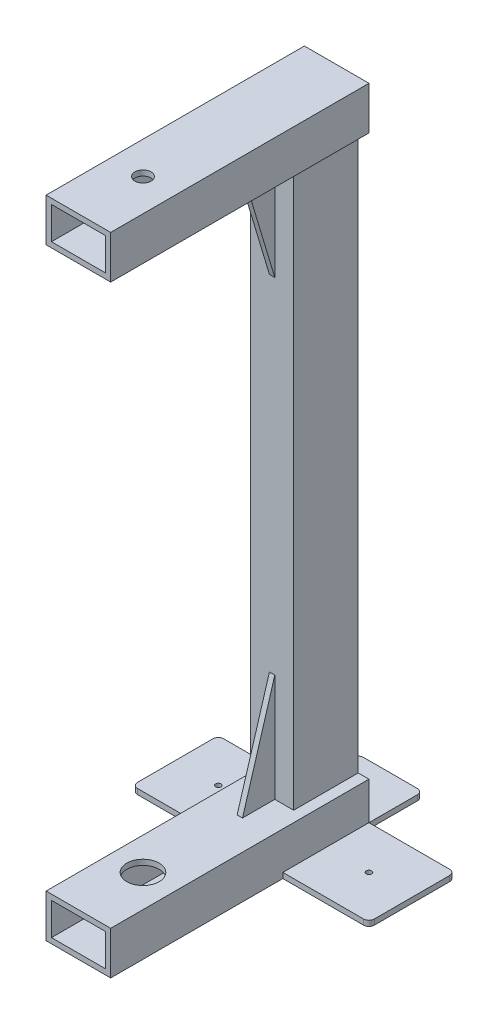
ISO-10303-21;
HEADER;
FILE_DESCRIPTION(('STEP AP214'),'2;1');
FILE_NAME('part.step','',(''),(''),'','','');
FILE_SCHEMA(('AUTOMOTIVE_DESIGN { 1 0 10303 214 1 1 1 1 }'));
ENDSEC;
DATA;
#1=APPLICATION_CONTEXT('core data for automotive mechanical design processes');
#2=APPLICATION_PROTOCOL_DEFINITION('international standard','automotive_design',2000,#1);
#3=PRODUCT_CONTEXT('',#1,'mechanical');
#4=PRODUCT('Part','Part','',(#3));
#5=PRODUCT_RELATED_PRODUCT_CATEGORY('part','',(#4));
#6=PRODUCT_DEFINITION_FORMATION('','',#4);
#7=PRODUCT_DEFINITION_CONTEXT('part definition',#1,'design');
#8=PRODUCT_DEFINITION('design','',#6,#7);
#9=PRODUCT_DEFINITION_SHAPE('','',#8);
#10=(LENGTH_UNIT() NAMED_UNIT(*) SI_UNIT(.MILLI.,.METRE.));
#11=(NAMED_UNIT(*) PLANE_ANGLE_UNIT() SI_UNIT($,.RADIAN.));
#12=(NAMED_UNIT(*) SI_UNIT($,.STERADIAN.) SOLID_ANGLE_UNIT());
#13=UNCERTAINTY_MEASURE_WITH_UNIT(LENGTH_MEASURE(1.E-05),#10,'distance_accuracy_value','');
#14=(GEOMETRIC_REPRESENTATION_CONTEXT(3) GLOBAL_UNCERTAINTY_ASSIGNED_CONTEXT((#13)) GLOBAL_UNIT_ASSIGNED_CONTEXT((#10,
#11,#12)) REPRESENTATION_CONTEXT('',''));
#15=CARTESIAN_POINT('',(0.,0.,0.));
#16=DIRECTION('',(0.,0.,1.));
#17=DIRECTION('',(1.,0.,0.));
#18=AXIS2_PLACEMENT_3D('',#15,#16,#17);
#19=CARTESIAN_POINT('',(-3.175,-203.2,76.2));
#20=DIRECTION('',(0.,0.287347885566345,0.957826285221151));
#21=DIRECTION('',(0.,-0.957826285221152,0.287347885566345));
#22=AXIS2_PLACEMENT_3D('',#19,#20,#21);
#23=PLANE('',#22);
#24=DIRECTION('',(1.,0.,0.));
#25=VECTOR('',#24,1.);
#26=CARTESIAN_POINT('',(-3.175,-330.2,114.3));
#27=LINE('',#26,#25);
#28=CARTESIAN_POINT('',(-3.175,-330.2,114.3));
#29=VERTEX_POINT('',#28);
#30=CARTESIAN_POINT('',(3.175,-330.2,114.3));
#31=VERTEX_POINT('',#30);
#32=EDGE_CURVE('E49',#29,#31,#27,.T.);
#33=ORIENTED_EDGE('',*,*,#32,.T.);
#34=DIRECTION('',(0.,-0.957826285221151,0.287347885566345));
#35=VECTOR('',#34,1.);
#36=CARTESIAN_POINT('',(3.175,-203.2,76.2));
#37=LINE('',#36,#35);
#38=CARTESIAN_POINT('',(3.175,-203.2,76.2));
#39=VERTEX_POINT('',#38);
#40=EDGE_CURVE('E80',#39,#31,#37,.T.);
#41=ORIENTED_EDGE('',*,*,#40,.F.);
#42=DIRECTION('',(1.,0.,0.));
#43=VECTOR('',#42,1.);
#44=CARTESIAN_POINT('',(-3.175,-203.2,76.2));
#45=LINE('',#44,#43);
#46=CARTESIAN_POINT('',(-3.175,-203.2,76.2));
#47=VERTEX_POINT('',#46);
#48=EDGE_CURVE('E12',#47,#39,#45,.T.);
#49=ORIENTED_EDGE('',*,*,#48,.F.);
#50=DIRECTION('',(0.,-0.957826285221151,0.287347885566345));
#51=VECTOR('',#50,1.);
#52=CARTESIAN_POINT('',(-3.175,-203.2,76.2));
#53=LINE('',#52,#51);
#54=EDGE_CURVE('E81',#47,#29,#53,.T.);
#55=ORIENTED_EDGE('',*,*,#54,.T.);
#56=EDGE_LOOP('',(#33,#41,#49,#55));
#57=FACE_BOUND('',#56,.T.);
#58=ADVANCED_FACE('F46',(#57),#23,.T.);
#59=CARTESIAN_POINT('',(-3.175,-330.2,76.2));
#60=DIRECTION('',(0.,0.,-1.));
#61=DIRECTION('',(0.,1.,0.));
#62=AXIS2_PLACEMENT_3D('',#59,#60,#61);
#63=PLANE('',#62);
#64=ORIENTED_EDGE('',*,*,#48,.T.);
#65=DIRECTION('',(0.,1.,0.));
#66=VECTOR('',#65,1.);
#67=CARTESIAN_POINT('',(3.175,-330.2,76.2));
#68=LINE('',#67,#66);
#69=CARTESIAN_POINT('',(3.175,-330.2,76.2));
#70=VERTEX_POINT('',#69);
#71=EDGE_CURVE('E90',#70,#39,#68,.T.);
#72=ORIENTED_EDGE('',*,*,#71,.F.);
#73=DIRECTION('',(1.,0.,0.));
#74=VECTOR('',#73,1.);
#75=CARTESIAN_POINT('',(-3.175,-330.2,76.2));
#76=LINE('',#75,#74);
#77=CARTESIAN_POINT('',(-3.175,-330.2,76.2));
#78=VERTEX_POINT('',#77);
#79=EDGE_CURVE('E54',#78,#70,#76,.T.);
#80=ORIENTED_EDGE('',*,*,#79,.F.);
#81=DIRECTION('',(0.,1.,0.));
#82=VECTOR('',#81,1.);
#83=CARTESIAN_POINT('',(-3.175,-330.2,76.2));
#84=LINE('',#83,#82);
#85=EDGE_CURVE('E84',#78,#47,#84,.T.);
#86=ORIENTED_EDGE('',*,*,#85,.T.);
#87=EDGE_LOOP('',(#64,#72,#80,#86));
#88=FACE_BOUND('',#87,.T.);
#89=ADVANCED_FACE('F100',(#88),#63,.T.);
#90=CARTESIAN_POINT('',(-3.175,-330.2,114.3));
#91=DIRECTION('',(0.,-1.,0.));
#92=DIRECTION('',(0.,0.,-1.));
#93=AXIS2_PLACEMENT_3D('',#90,#91,#92);
#94=PLANE('',#93);
#95=ORIENTED_EDGE('',*,*,#79,.T.);
#96=DIRECTION('',(0.,0.,-1.));
#97=VECTOR('',#96,1.);
#98=CARTESIAN_POINT('',(3.175,-330.2,114.3));
#99=LINE('',#98,#97);
#100=EDGE_CURVE('E86',#31,#70,#99,.T.);
#101=ORIENTED_EDGE('',*,*,#100,.F.);
#102=ORIENTED_EDGE('',*,*,#32,.F.);
#103=DIRECTION('',(0.,0.,-1.));
#104=VECTOR('',#103,1.);
#105=CARTESIAN_POINT('',(-3.175,-330.2,114.3));
#106=LINE('',#105,#104);
#107=EDGE_CURVE('E97',#29,#78,#106,.T.);
#108=ORIENTED_EDGE('',*,*,#107,.T.);
#109=EDGE_LOOP('',(#95,#101,#102,#108));
#110=FACE_BOUND('',#109,.T.);
#111=ADVANCED_FACE('F87',(#110),#94,.T.);
#112=CARTESIAN_POINT('',(-3.175,0.,0.));
#113=DIRECTION('',(1.,0.,0.));
#114=DIRECTION('',(0.,0.,-1.));
#115=AXIS2_PLACEMENT_3D('',#112,#113,#114);
#116=PLANE('',#115);
#117=ORIENTED_EDGE('',*,*,#54,.F.);
#118=ORIENTED_EDGE('',*,*,#85,.F.);
#119=ORIENTED_EDGE('',*,*,#107,.F.);
#120=EDGE_LOOP('',(#117,#118,#119));
#121=FACE_BOUND('',#120,.T.);
#122=ADVANCED_FACE('F102',(#121),#116,.F.);
#123=CARTESIAN_POINT('',(3.175,0.,0.));
#124=DIRECTION('',(1.,0.,0.));
#125=DIRECTION('',(0.,0.,-1.));
#126=AXIS2_PLACEMENT_3D('',#123,#124,#125);
#127=PLANE('',#126);
#128=ORIENTED_EDGE('',*,*,#40,.T.);
#129=ORIENTED_EDGE('',*,*,#100,.T.);
#130=ORIENTED_EDGE('',*,*,#71,.T.);
#131=EDGE_LOOP('',(#128,#129,#130));
#132=FACE_BOUND('',#131,.T.);
#133=ADVANCED_FACE('F92',(#132),#127,.T.);
#134=CLOSED_SHELL('',(#58,#89,#111,#122,#133));
#135=MANIFOLD_SOLID_BREP('B2',#134);
#136=CARTESIAN_POINT('',(-3.175,203.2,76.2));
#137=DIRECTION('',(0.,-0.287347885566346,0.957826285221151));
#138=DIRECTION('',(0.,-0.957826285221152,-0.287347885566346));
#139=AXIS2_PLACEMENT_3D('',#136,#137,#138);
#140=PLANE('',#139);
#141=DIRECTION('',(1.,0.,0.));
#142=VECTOR('',#141,1.);
#143=CARTESIAN_POINT('',(-3.175,203.2,76.2));
#144=LINE('',#143,#142);
#145=CARTESIAN_POINT('',(-3.175,203.2,76.2));
#146=VERTEX_POINT('',#145);
#147=CARTESIAN_POINT('',(3.175,203.2,76.2));
#148=VERTEX_POINT('',#147);
#149=EDGE_CURVE('E157',#146,#148,#144,.T.);
#150=ORIENTED_EDGE('',*,*,#149,.T.);
#151=DIRECTION('',(0.,-0.957826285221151,-0.287347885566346));
#152=VECTOR('',#151,1.);
#153=CARTESIAN_POINT('',(3.175,203.2,76.2));
#154=LINE('',#153,#152);
#155=CARTESIAN_POINT('',(3.175,330.2,114.3));
#156=VERTEX_POINT('',#155);
#157=EDGE_CURVE('E188',#156,#148,#154,.T.);
#158=ORIENTED_EDGE('',*,*,#157,.F.);
#159=DIRECTION('',(1.,0.,0.));
#160=VECTOR('',#159,1.);
#161=CARTESIAN_POINT('',(-3.175,330.2,114.3));
#162=LINE('',#161,#160);
#163=CARTESIAN_POINT('',(-3.175,330.2,114.3));
#164=VERTEX_POINT('',#163);
#165=EDGE_CURVE('E44',#164,#156,#162,.T.);
#166=ORIENTED_EDGE('',*,*,#165,.F.);
#167=DIRECTION('',(0.,-0.957826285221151,-0.287347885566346));
#168=VECTOR('',#167,1.);
#169=CARTESIAN_POINT('',(-3.175,203.2,76.2));
#170=LINE('',#169,#168);
#171=EDGE_CURVE('E189',#164,#146,#170,.T.);
#172=ORIENTED_EDGE('',*,*,#171,.T.);
#173=EDGE_LOOP('',(#150,#158,#166,#172));
#174=FACE_BOUND('',#173,.T.);
#175=ADVANCED_FACE('F154',(#174),#140,.T.);
#176=CARTESIAN_POINT('',(-3.175,330.2,114.3));
#177=DIRECTION('',(0.,1.,0.));
#178=DIRECTION('',(0.,0.,1.));
#179=AXIS2_PLACEMENT_3D('',#176,#177,#178);
#180=PLANE('',#179);
#181=ORIENTED_EDGE('',*,*,#165,.T.);
#182=DIRECTION('',(0.,0.,1.));
#183=VECTOR('',#182,1.);
#184=CARTESIAN_POINT('',(3.175,330.2,114.3));
#185=LINE('',#184,#183);
#186=CARTESIAN_POINT('',(3.175,330.2,76.2));
#187=VERTEX_POINT('',#186);
#188=EDGE_CURVE('E198',#187,#156,#185,.T.);
#189=ORIENTED_EDGE('',*,*,#188,.F.);
#190=DIRECTION('',(1.,0.,0.));
#191=VECTOR('',#190,1.);
#192=CARTESIAN_POINT('',(-3.175,330.2,76.2));
#193=LINE('',#192,#191);
#194=CARTESIAN_POINT('',(-3.175,330.2,76.2));
#195=VERTEX_POINT('',#194);
#196=EDGE_CURVE('E162',#195,#187,#193,.T.);
#197=ORIENTED_EDGE('',*,*,#196,.F.);
#198=DIRECTION('',(0.,0.,1.));
#199=VECTOR('',#198,1.);
#200=CARTESIAN_POINT('',(-3.175,330.2,114.3));
#201=LINE('',#200,#199);
#202=EDGE_CURVE('E192',#195,#164,#201,.T.);
#203=ORIENTED_EDGE('',*,*,#202,.T.);
#204=EDGE_LOOP('',(#181,#189,#197,#203));
#205=FACE_BOUND('',#204,.T.);
#206=ADVANCED_FACE('F208',(#205),#180,.T.);
#207=CARTESIAN_POINT('',(-3.175,330.2,76.2));
#208=DIRECTION('',(0.,0.,-1.));
#209=DIRECTION('',(0.,1.,0.));
#210=AXIS2_PLACEMENT_3D('',#207,#208,#209);
#211=PLANE('',#210);
#212=ORIENTED_EDGE('',*,*,#196,.T.);
#213=DIRECTION('',(0.,1.,0.));
#214=VECTOR('',#213,1.);
#215=CARTESIAN_POINT('',(3.175,330.2,76.2));
#216=LINE('',#215,#214);
#217=EDGE_CURVE('E194',#148,#187,#216,.T.);
#218=ORIENTED_EDGE('',*,*,#217,.F.);
#219=ORIENTED_EDGE('',*,*,#149,.F.);
#220=DIRECTION('',(0.,1.,0.));
#221=VECTOR('',#220,1.);
#222=CARTESIAN_POINT('',(-3.175,330.2,76.2));
#223=LINE('',#222,#221);
#224=EDGE_CURVE('E205',#146,#195,#223,.T.);
#225=ORIENTED_EDGE('',*,*,#224,.T.);
#226=EDGE_LOOP('',(#212,#218,#219,#225));
#227=FACE_BOUND('',#226,.T.);
#228=ADVANCED_FACE('F195',(#227),#211,.T.);
#229=CARTESIAN_POINT('',(-3.175,0.,0.));
#230=DIRECTION('',(-1.,0.,0.));
#231=DIRECTION('',(0.,0.,1.));
#232=AXIS2_PLACEMENT_3D('',#229,#230,#231);
#233=PLANE('',#232);
#234=ORIENTED_EDGE('',*,*,#171,.F.);
#235=ORIENTED_EDGE('',*,*,#202,.F.);
#236=ORIENTED_EDGE('',*,*,#224,.F.);
#237=EDGE_LOOP('',(#234,#235,#236));
#238=FACE_BOUND('',#237,.T.);
#239=ADVANCED_FACE('F210',(#238),#233,.T.);
#240=CARTESIAN_POINT('',(3.175,0.,0.));
#241=DIRECTION('',(-1.,0.,0.));
#242=DIRECTION('',(0.,0.,1.));
#243=AXIS2_PLACEMENT_3D('',#240,#241,#242);
#244=PLANE('',#243);
#245=ORIENTED_EDGE('',*,*,#157,.T.);
#246=ORIENTED_EDGE('',*,*,#217,.T.);
#247=ORIENTED_EDGE('',*,*,#188,.T.);
#248=EDGE_LOOP('',(#245,#246,#247));
#249=FACE_BOUND('',#248,.T.);
#250=ADVANCED_FACE('F200',(#249),#244,.F.);
#251=CLOSED_SHELL('',(#175,#206,#228,#239,#250));
#252=MANIFOLD_SOLID_BREP('B6',#251);
#253=CARTESIAN_POINT('',(0.,0.,0.));
#254=DIRECTION('',(0.,0.,1.));
#255=DIRECTION('',(1.,0.,0.));
#256=AXIS2_PLACEMENT_3D('',#253,#254,#255);
#257=PLANE('',#256);
#258=DIRECTION('',(1.,0.,0.));
#259=VECTOR('',#258,1.);
#260=CARTESIAN_POINT('',(-38.1,-374.65,0.));
#261=LINE('',#260,#259);
#262=CARTESIAN_POINT('',(-38.1,-374.65,0.));
#263=VERTEX_POINT('',#262);
#264=CARTESIAN_POINT('',(-31.75,-374.65,0.));
#265=VERTEX_POINT('',#264);
#266=EDGE_CURVE('E673',#263,#265,#261,.T.);
#267=ORIENTED_EDGE('',*,*,#266,.F.);
#268=DIRECTION('',(0.,1.,0.));
#269=VECTOR('',#268,1.);
#270=CARTESIAN_POINT('',(-38.1,-381.,0.));
#271=LINE('',#270,#269);
#272=CARTESIAN_POINT('',(-38.1,-330.2,0.));
#273=VERTEX_POINT('',#272);
#274=EDGE_CURVE('E438',#263,#273,#271,.T.);
#275=ORIENTED_EDGE('',*,*,#274,.T.);
#276=DIRECTION('',(1.,0.,0.));
#277=VECTOR('',#276,1.);
#278=CARTESIAN_POINT('',(38.1,-330.2,0.));
#279=LINE('',#278,#277);
#280=CARTESIAN_POINT('',(38.1,-330.2,0.));
#281=VERTEX_POINT('',#280);
#282=EDGE_CURVE('E530',#273,#281,#279,.T.);
#283=ORIENTED_EDGE('',*,*,#282,.T.);
#284=DIRECTION('',(0.,-1.,0.));
#285=VECTOR('',#284,1.);
#286=CARTESIAN_POINT('',(38.1,-381.,0.));
#287=LINE('',#286,#285);
#288=CARTESIAN_POINT('',(38.1,-374.65,0.));
#289=VERTEX_POINT('',#288);
#290=EDGE_CURVE('E525',#281,#289,#287,.T.);
#291=ORIENTED_EDGE('',*,*,#290,.T.);
#292=CARTESIAN_POINT('',(31.75,-374.65,0.));
#293=VERTEX_POINT('',#292);
#294=EDGE_CURVE('E547',#293,#289,#261,.T.);
#295=ORIENTED_EDGE('',*,*,#294,.F.);
#296=DIRECTION('',(0.,1.,0.));
#297=VECTOR('',#296,1.);
#298=CARTESIAN_POINT('',(31.75,-374.65,0.));
#299=LINE('',#298,#297);
#300=CARTESIAN_POINT('',(31.75,-336.55,0.));
#301=VERTEX_POINT('',#300);
#302=EDGE_CURVE('E460',#293,#301,#299,.T.);
#303=ORIENTED_EDGE('',*,*,#302,.T.);
#304=DIRECTION('',(-1.,0.,0.));
#305=VECTOR('',#304,1.);
#306=CARTESIAN_POINT('',(31.75,-336.55,0.));
#307=LINE('',#306,#305);
#308=CARTESIAN_POINT('',(-31.75,-336.55,0.));
#309=VERTEX_POINT('',#308);
#310=EDGE_CURVE('E463',#301,#309,#307,.T.);
#311=ORIENTED_EDGE('',*,*,#310,.T.);
#312=DIRECTION('',(0.,-1.,0.));
#313=VECTOR('',#312,1.);
#314=CARTESIAN_POINT('',(-31.75,-336.55,0.));
#315=LINE('',#314,#313);
#316=EDGE_CURVE('E467',#309,#265,#315,.T.);
#317=ORIENTED_EDGE('',*,*,#316,.T.);
#318=EDGE_LOOP('',(#267,#275,#283,#291,#295,#303,#311,#317));
#319=FACE_BOUND('',#318,.T.);
#320=ADVANCED_FACE('F262',(#319),#257,.F.);
#321=DIRECTION('',(1.,0.,0.));
#322=VECTOR('',#321,1.);
#323=CARTESIAN_POINT('',(38.1,-374.65,0.));
#324=LINE('',#323,#322);
#325=CARTESIAN_POINT('',(133.35,-374.65,0.));
#326=VERTEX_POINT('',#325);
#327=EDGE_CURVE('E495',#289,#326,#324,.T.);
#328=ORIENTED_EDGE('',*,*,#327,.T.);
#329=DIRECTION('',(0.,-1.,0.));
#330=VECTOR('',#329,1.);
#331=CARTESIAN_POINT('',(133.35,-381.,0.));
#332=LINE('',#331,#330);
#333=CARTESIAN_POINT('',(133.35,-381.,0.));
#334=VERTEX_POINT('',#333);
#335=EDGE_CURVE('E437',#326,#334,#332,.T.);
#336=ORIENTED_EDGE('',*,*,#335,.T.);
#337=DIRECTION('',(-1.,0.,0.));
#338=VECTOR('',#337,1.);
#339=CARTESIAN_POINT('',(38.1,-381.,0.));
#340=LINE('',#339,#338);
#341=CARTESIAN_POINT('',(38.1,-381.,0.));
#342=VERTEX_POINT('',#341);
#343=EDGE_CURVE('E422',#334,#342,#340,.T.);
#344=ORIENTED_EDGE('',*,*,#343,.T.);
#345=DIRECTION('',(0.,-1.,0.));
#346=VECTOR('',#345,1.);
#347=CARTESIAN_POINT('',(38.1,-275.459829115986,0.));
#348=LINE('',#347,#346);
#349=EDGE_CURVE('E428',#289,#342,#348,.T.);
#350=ORIENTED_EDGE('',*,*,#349,.F.);
#351=EDGE_LOOP('',(#328,#336,#344,#350));
#352=FACE_BOUND('',#351,.T.);
#353=ADVANCED_FACE('F434',(#352),#257,.F.);
#354=CARTESIAN_POINT('',(-38.1,-381.,304.8));
#355=DIRECTION('',(-1.,0.,0.));
#356=DIRECTION('',(0.,0.,1.));
#357=AXIS2_PLACEMENT_3D('',#354,#355,#356);
#358=PLANE('',#357);
#359=ORIENTED_EDGE('',*,*,#274,.F.);
#360=DIRECTION('',(0.,0.,1.));
#361=VECTOR('',#360,1.);
#362=CARTESIAN_POINT('',(-38.1,-374.65,101.6));
#363=LINE('',#362,#361);
#364=CARTESIAN_POINT('',(-38.1,-374.65,101.6));
#365=VERTEX_POINT('',#364);
#366=EDGE_CURVE('E509',#263,#365,#363,.T.);
#367=ORIENTED_EDGE('',*,*,#366,.T.);
#368=DIRECTION('',(0.,-1.,0.));
#369=VECTOR('',#368,1.);
#370=CARTESIAN_POINT('',(-38.1,-374.65,101.6));
#371=LINE('',#370,#369);
#372=CARTESIAN_POINT('',(-38.1,-381.,101.6));
#373=VERTEX_POINT('',#372);
#374=EDGE_CURVE('E519',#365,#373,#371,.T.);
#375=ORIENTED_EDGE('',*,*,#374,.T.);
#376=DIRECTION('',(0.,0.,-1.));
#377=VECTOR('',#376,1.);
#378=CARTESIAN_POINT('',(-38.1,-381.,304.8));
#379=LINE('',#378,#377);
#380=CARTESIAN_POINT('',(-38.1,-381.,304.8));
#381=VERTEX_POINT('',#380);
#382=EDGE_CURVE('E551',#381,#373,#379,.T.);
#383=ORIENTED_EDGE('',*,*,#382,.F.);
#384=DIRECTION('',(0.,1.,0.));
#385=VECTOR('',#384,1.);
#386=CARTESIAN_POINT('',(-38.1,-381.,304.8));
#387=LINE('',#386,#385);
#388=CARTESIAN_POINT('',(-38.1,-330.2,304.8));
#389=VERTEX_POINT('',#388);
#390=EDGE_CURVE('E533',#381,#389,#387,.T.);
#391=ORIENTED_EDGE('',*,*,#390,.T.);
#392=DIRECTION('',(0.,0.,-1.));
#393=VECTOR('',#392,1.);
#394=CARTESIAN_POINT('',(-38.1,-330.2,304.8));
#395=LINE('',#394,#393);
#396=EDGE_CURVE('E548',#389,#273,#395,.T.);
#397=ORIENTED_EDGE('',*,*,#396,.T.);
#398=EDGE_LOOP('',(#359,#367,#375,#383,#391,#397));
#399=FACE_BOUND('',#398,.T.);
#400=ADVANCED_FACE('F635',(#399),#358,.T.);
#401=CARTESIAN_POINT('',(38.1,-381.,304.8));
#402=DIRECTION('',(1.,0.,0.));
#403=DIRECTION('',(0.,0.,-1.));
#404=AXIS2_PLACEMENT_3D('',#401,#402,#403);
#405=PLANE('',#404);
#406=DIRECTION('',(0.,-1.,0.));
#407=VECTOR('',#406,1.);
#408=CARTESIAN_POINT('',(38.1,-374.65,101.6));
#409=LINE('',#408,#407);
#410=CARTESIAN_POINT('',(38.1,-374.65,101.6));
#411=VERTEX_POINT('',#410);
#412=CARTESIAN_POINT('',(38.1,-381.,101.6));
#413=VERTEX_POINT('',#412);
#414=EDGE_CURVE('E499',#411,#413,#409,.T.);
#415=ORIENTED_EDGE('',*,*,#414,.F.);
#416=DIRECTION('',(0.,0.,-1.));
#417=VECTOR('',#416,1.);
#418=CARTESIAN_POINT('',(38.1,-374.65,101.6));
#419=LINE('',#418,#417);
#420=EDGE_CURVE('E491',#411,#289,#419,.T.);
#421=ORIENTED_EDGE('',*,*,#420,.T.);
#422=ORIENTED_EDGE('',*,*,#290,.F.);
#423=DIRECTION('',(0.,0.,-1.));
#424=VECTOR('',#423,1.);
#425=CARTESIAN_POINT('',(38.1,-330.2,304.8));
#426=LINE('',#425,#424);
#427=CARTESIAN_POINT('',(38.1,-330.2,304.8));
#428=VERTEX_POINT('',#427);
#429=EDGE_CURVE('E545',#428,#281,#426,.T.);
#430=ORIENTED_EDGE('',*,*,#429,.F.);
#431=DIRECTION('',(0.,-1.,0.));
#432=VECTOR('',#431,1.);
#433=CARTESIAN_POINT('',(38.1,-381.,304.8));
#434=LINE('',#433,#432);
#435=CARTESIAN_POINT('',(38.1,-381.,304.8));
#436=VERTEX_POINT('',#435);
#437=EDGE_CURVE('E526',#428,#436,#434,.T.);
#438=ORIENTED_EDGE('',*,*,#437,.T.);
#439=DIRECTION('',(0.,0.,-1.));
#440=VECTOR('',#439,1.);
#441=CARTESIAN_POINT('',(38.1,-381.,304.8));
#442=LINE('',#441,#440);
#443=EDGE_CURVE('E539',#436,#413,#442,.T.);
#444=ORIENTED_EDGE('',*,*,#443,.T.);
#445=EDGE_LOOP('',(#415,#421,#422,#430,#438,#444));
#446=FACE_BOUND('',#445,.T.);
#447=ADVANCED_FACE('F626',(#446),#405,.T.);
#448=CARTESIAN_POINT('',(38.1,-330.2,304.8));
#449=DIRECTION('',(0.,1.,0.));
#450=DIRECTION('',(0.,0.,1.));
#451=AXIS2_PLACEMENT_3D('',#448,#449,#450);
#452=PLANE('',#451);
#453=CARTESIAN_POINT('',(0.,-330.2,228.6));
#454=DIRECTION('',(0.,1.,0.));
#455=DIRECTION('',(0.,0.,1.));
#456=AXIS2_PLACEMENT_3D('',#453,#454,#455);
#457=CIRCLE('',#456,19.05);
#458=CARTESIAN_POINT('',(0.,-330.2,247.65));
#459=VERTEX_POINT('',#458);
#460=EDGE_CURVE('E456',#459,#459,#457,.T.);
#461=ORIENTED_EDGE('',*,*,#460,.F.);
#462=EDGE_LOOP('',(#461));
#463=FACE_BOUND('',#462,.T.);
#464=ORIENTED_EDGE('',*,*,#282,.F.);
#465=ORIENTED_EDGE('',*,*,#396,.F.);
#466=DIRECTION('',(1.,0.,0.));
#467=VECTOR('',#466,1.);
#468=CARTESIAN_POINT('',(38.1,-330.2,304.8));
#469=LINE('',#468,#467);
#470=EDGE_CURVE('E536',#389,#428,#469,.T.);
#471=ORIENTED_EDGE('',*,*,#470,.T.);
#472=ORIENTED_EDGE('',*,*,#429,.T.);
#473=EDGE_LOOP('',(#464,#465,#471,#472));
#474=FACE_BOUND('',#473,.T.);
#475=ADVANCED_FACE('F721',(#463,#474),#452,.T.);
#476=CARTESIAN_POINT('',(38.1,-381.,304.8));
#477=DIRECTION('',(0.,-1.,0.));
#478=DIRECTION('',(0.,0.,-1.));
#479=AXIS2_PLACEMENT_3D('',#476,#477,#478);
#480=PLANE('',#479);
#481=CARTESIAN_POINT('',(-88.9,-381.,50.8));
#482=DIRECTION('',(0.,1.,0.));
#483=DIRECTION('',(0.,0.,1.));
#484=AXIS2_PLACEMENT_3D('',#481,#482,#483);
#485=CIRCLE('',#484,3.175);
#486=CARTESIAN_POINT('',(-88.9,-381.,53.975));
#487=VERTEX_POINT('',#486);
#488=EDGE_CURVE('E560',#487,#487,#485,.T.);
#489=ORIENTED_EDGE('',*,*,#488,.T.);
#490=EDGE_LOOP('',(#489));
#491=FACE_BOUND('',#490,.T.);
#492=CARTESIAN_POINT('',(0.,-381.,-31.75));
#493=DIRECTION('',(0.,1.,0.));
#494=DIRECTION('',(0.,0.,1.));
#495=AXIS2_PLACEMENT_3D('',#492,#493,#494);
#496=CIRCLE('',#495,3.175);
#497=CARTESIAN_POINT('',(0.,-381.,-28.575));
#498=VERTEX_POINT('',#497);
#499=EDGE_CURVE('E680',#498,#498,#496,.T.);
#500=ORIENTED_EDGE('',*,*,#499,.T.);
#501=EDGE_LOOP('',(#500));
#502=FACE_BOUND('',#501,.T.);
#503=CARTESIAN_POINT('',(88.9,-381.,50.8));
#504=DIRECTION('',(0.,1.,0.));
#505=DIRECTION('',(0.,0.,1.));
#506=AXIS2_PLACEMENT_3D('',#503,#504,#505);
#507=CIRCLE('',#506,3.175);
#508=CARTESIAN_POINT('',(88.9,-381.,53.975));
#509=VERTEX_POINT('',#508);
#510=EDGE_CURVE('E677',#509,#509,#507,.T.);
#511=ORIENTED_EDGE('',*,*,#510,.T.);
#512=EDGE_LOOP('',(#511));
#513=FACE_BOUND('',#512,.T.);
#514=DIRECTION('',(0.,0.,-1.));
#515=VECTOR('',#514,1.);
#516=CARTESIAN_POINT('',(-139.7,-381.,0.));
#517=LINE('',#516,#515);
#518=CARTESIAN_POINT('',(-139.7,-381.,95.25));
#519=VERTEX_POINT('',#518);
#520=CARTESIAN_POINT('',(-139.7,-381.,6.35));
#521=VERTEX_POINT('',#520);
#522=EDGE_CURVE('E510',#519,#521,#517,.T.);
#523=ORIENTED_EDGE('',*,*,#522,.T.);
#524=CARTESIAN_POINT('',(-133.35,-381.,6.35));
#525=DIRECTION('',(0.,-1.,0.));
#526=DIRECTION('',(0.,0.,-1.));
#527=AXIS2_PLACEMENT_3D('',#524,#525,#526);
#528=CIRCLE('',#527,6.35);
#529=CARTESIAN_POINT('',(-133.35,-381.,0.));
#530=VERTEX_POINT('',#529);
#531=EDGE_CURVE('E581',#521,#530,#528,.T.);
#532=ORIENTED_EDGE('',*,*,#531,.T.);
#533=CARTESIAN_POINT('',(-38.1,-381.,0.));
#534=VERTEX_POINT('',#533);
#535=EDGE_CURVE('E439',#534,#530,#340,.T.);
#536=ORIENTED_EDGE('',*,*,#535,.F.);
#537=DIRECTION('',(0.,0.,-1.));
#538=VECTOR('',#537,1.);
#539=CARTESIAN_POINT('',(-38.1,-381.,0.));
#540=LINE('',#539,#538);
#541=CARTESIAN_POINT('',(-38.1,-381.,-57.15));
#542=VERTEX_POINT('',#541);
#543=EDGE_CURVE('E566',#534,#542,#540,.T.);
#544=ORIENTED_EDGE('',*,*,#543,.T.);
#545=CARTESIAN_POINT('',(-31.75,-381.,-57.15));
#546=DIRECTION('',(0.,-1.,0.));
#547=DIRECTION('',(0.,0.,-1.));
#548=AXIS2_PLACEMENT_3D('',#545,#546,#547);
#549=CIRCLE('',#548,6.35);
#550=CARTESIAN_POINT('',(-31.75,-381.,-63.5));
#551=VERTEX_POINT('',#550);
#552=EDGE_CURVE('E579',#542,#551,#549,.T.);
#553=ORIENTED_EDGE('',*,*,#552,.T.);
#554=DIRECTION('',(1.,0.,0.));
#555=VECTOR('',#554,1.);
#556=CARTESIAN_POINT('',(-38.1,-381.,-63.5));
#557=LINE('',#556,#555);
#558=CARTESIAN_POINT('',(31.75,-381.,-63.5));
#559=VERTEX_POINT('',#558);
#560=EDGE_CURVE('E429',#551,#559,#557,.T.);
#561=ORIENTED_EDGE('',*,*,#560,.T.);
#562=CARTESIAN_POINT('',(31.75,-381.,-57.15));
#563=DIRECTION('',(0.,-1.,0.));
#564=DIRECTION('',(0.,0.,-1.));
#565=AXIS2_PLACEMENT_3D('',#562,#563,#564);
#566=CIRCLE('',#565,6.35);
#567=CARTESIAN_POINT('',(38.1,-381.,-57.15));
#568=VERTEX_POINT('',#567);
#569=EDGE_CURVE('E424',#559,#568,#566,.T.);
#570=ORIENTED_EDGE('',*,*,#569,.T.);
#571=DIRECTION('',(0.,0.,1.));
#572=VECTOR('',#571,1.);
#573=CARTESIAN_POINT('',(38.1,-381.,0.));
#574=LINE('',#573,#572);
#575=EDGE_CURVE('E418',#568,#342,#574,.T.);
#576=ORIENTED_EDGE('',*,*,#575,.T.);
#577=ORIENTED_EDGE('',*,*,#343,.F.);
#578=CARTESIAN_POINT('',(133.35,-381.,6.35));
#579=DIRECTION('',(0.,-1.,0.));
#580=DIRECTION('',(0.,0.,-1.));
#581=AXIS2_PLACEMENT_3D('',#578,#579,#580);
#582=CIRCLE('',#581,6.35);
#583=CARTESIAN_POINT('',(139.7,-381.,6.35));
#584=VERTEX_POINT('',#583);
#585=EDGE_CURVE('E576',#334,#584,#582,.T.);
#586=ORIENTED_EDGE('',*,*,#585,.T.);
#587=DIRECTION('',(0.,0.,1.));
#588=VECTOR('',#587,1.);
#589=CARTESIAN_POINT('',(139.7,-381.,0.));
#590=LINE('',#589,#588);
#591=CARTESIAN_POINT('',(139.7,-381.,95.25));
#592=VERTEX_POINT('',#591);
#593=EDGE_CURVE('E492',#584,#592,#590,.T.);
#594=ORIENTED_EDGE('',*,*,#593,.T.);
#595=CARTESIAN_POINT('',(133.35,-381.,95.25));
#596=DIRECTION('',(0.,-1.,0.));
#597=DIRECTION('',(0.,0.,-1.));
#598=AXIS2_PLACEMENT_3D('',#595,#596,#597);
#599=CIRCLE('',#598,6.35);
#600=CARTESIAN_POINT('',(133.35,-381.,101.6));
#601=VERTEX_POINT('',#600);
#602=EDGE_CURVE('E574',#592,#601,#599,.T.);
#603=ORIENTED_EDGE('',*,*,#602,.T.);
#604=DIRECTION('',(-1.,0.,0.));
#605=VECTOR('',#604,1.);
#606=CARTESIAN_POINT('',(38.1,-381.,101.6));
#607=LINE('',#606,#605);
#608=EDGE_CURVE('E482',#601,#413,#607,.T.);
#609=ORIENTED_EDGE('',*,*,#608,.T.);
#610=ORIENTED_EDGE('',*,*,#443,.F.);
#611=DIRECTION('',(-1.,0.,0.));
#612=VECTOR('',#611,1.);
#613=CARTESIAN_POINT('',(38.1,-381.,304.8));
#614=LINE('',#613,#612);
#615=EDGE_CURVE('E529',#436,#381,#614,.T.);
#616=ORIENTED_EDGE('',*,*,#615,.T.);
#617=ORIENTED_EDGE('',*,*,#382,.T.);
#618=DIRECTION('',(-1.,0.,0.));
#619=VECTOR('',#618,1.);
#620=CARTESIAN_POINT('',(-139.7,-381.,101.6));
#621=LINE('',#620,#619);
#622=CARTESIAN_POINT('',(-133.35,-381.,101.6));
#623=VERTEX_POINT('',#622);
#624=EDGE_CURVE('E505',#373,#623,#621,.T.);
#625=ORIENTED_EDGE('',*,*,#624,.T.);
#626=CARTESIAN_POINT('',(-133.35,-381.,95.25));
#627=DIRECTION('',(0.,-1.,0.));
#628=DIRECTION('',(0.,0.,-1.));
#629=AXIS2_PLACEMENT_3D('',#626,#627,#628);
#630=CIRCLE('',#629,6.35);
#631=EDGE_CURVE('E572',#623,#519,#630,.T.);
#632=ORIENTED_EDGE('',*,*,#631,.T.);
#633=EDGE_LOOP('',(#523,#532,#536,#544,#553,#561,#570,#576,#577,#586,#594,#603,#609,#610,#616,
#617,#625,#632));
#634=FACE_BOUND('',#633,.T.);
#635=ADVANCED_FACE('F421',(#491,#502,#513,#634),#480,.T.);
#636=CARTESIAN_POINT('',(0.,0.,304.8));
#637=DIRECTION('',(0.,0.,1.));
#638=DIRECTION('',(1.,0.,0.));
#639=AXIS2_PLACEMENT_3D('',#636,#637,#638);
#640=PLANE('',#639);
#641=DIRECTION('',(1.,0.,0.));
#642=VECTOR('',#641,1.);
#643=CARTESIAN_POINT('',(-31.75,-374.65,304.8));
#644=LINE('',#643,#642);
#645=CARTESIAN_POINT('',(-31.75,-374.65,304.8));
#646=VERTEX_POINT('',#645);
#647=CARTESIAN_POINT('',(31.75,-374.65,304.8));
#648=VERTEX_POINT('',#647);
#649=EDGE_CURVE('E459',#646,#648,#644,.T.);
#650=ORIENTED_EDGE('',*,*,#649,.F.);
#651=DIRECTION('',(0.,-1.,0.));
#652=VECTOR('',#651,1.);
#653=CARTESIAN_POINT('',(-31.75,-336.55,304.8));
#654=LINE('',#653,#652);
#655=CARTESIAN_POINT('',(-31.75,-336.55,304.8));
#656=VERTEX_POINT('',#655);
#657=EDGE_CURVE('E464',#656,#646,#654,.T.);
#658=ORIENTED_EDGE('',*,*,#657,.F.);
#659=DIRECTION('',(-1.,0.,0.));
#660=VECTOR('',#659,1.);
#661=CARTESIAN_POINT('',(31.75,-336.55,304.8));
#662=LINE('',#661,#660);
#663=CARTESIAN_POINT('',(31.75,-336.55,304.8));
#664=VERTEX_POINT('',#663);
#665=EDGE_CURVE('E475',#664,#656,#662,.T.);
#666=ORIENTED_EDGE('',*,*,#665,.F.);
#667=DIRECTION('',(0.,1.,0.));
#668=VECTOR('',#667,1.);
#669=CARTESIAN_POINT('',(31.75,-374.65,304.8));
#670=LINE('',#669,#668);
#671=EDGE_CURVE('E472',#648,#664,#670,.T.);
#672=ORIENTED_EDGE('',*,*,#671,.F.);
#673=EDGE_LOOP('',(#650,#658,#666,#672));
#674=FACE_BOUND('',#673,.T.);
#675=ORIENTED_EDGE('',*,*,#437,.F.);
#676=ORIENTED_EDGE('',*,*,#470,.F.);
#677=ORIENTED_EDGE('',*,*,#390,.F.);
#678=ORIENTED_EDGE('',*,*,#615,.F.);
#679=EDGE_LOOP('',(#675,#676,#677,#678));
#680=FACE_BOUND('',#679,.T.);
#681=ADVANCED_FACE('F631',(#674,#680),#640,.T.);
#682=ORIENTED_EDGE('',*,*,#535,.T.);
#683=DIRECTION('',(0.,-1.,0.));
#684=VECTOR('',#683,1.);
#685=CARTESIAN_POINT('',(-133.35,-374.65,0.));
#686=LINE('',#685,#684);
#687=CARTESIAN_POINT('',(-133.35,-374.65,0.));
#688=VERTEX_POINT('',#687);
#689=EDGE_CURVE('E583',#530,#688,#686,.F.);
#690=ORIENTED_EDGE('',*,*,#689,.T.);
#691=DIRECTION('',(1.,0.,0.));
#692=VECTOR('',#691,1.);
#693=CARTESIAN_POINT('',(-38.1,-374.65,0.));
#694=LINE('',#693,#692);
#695=EDGE_CURVE('E506',#688,#263,#694,.T.);
#696=ORIENTED_EDGE('',*,*,#695,.T.);
#697=DIRECTION('',(0.,-1.,0.));
#698=VECTOR('',#697,1.);
#699=CARTESIAN_POINT('',(-38.1,-275.459829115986,0.));
#700=LINE('',#699,#698);
#701=EDGE_CURVE('E445',#263,#534,#700,.T.);
#702=ORIENTED_EDGE('',*,*,#701,.T.);
#703=EDGE_LOOP('',(#682,#690,#696,#702));
#704=FACE_BOUND('',#703,.T.);
#705=ADVANCED_FACE('F662',(#704),#257,.F.);
#706=CARTESIAN_POINT('',(-139.7,-374.65,0.));
#707=DIRECTION('',(-1.,0.,0.));
#708=DIRECTION('',(0.,0.,1.));
#709=AXIS2_PLACEMENT_3D('',#706,#707,#708);
#710=PLANE('',#709);
#711=DIRECTION('',(0.,0.,-1.));
#712=VECTOR('',#711,1.);
#713=CARTESIAN_POINT('',(-139.7,-374.65,0.));
#714=LINE('',#713,#712);
#715=CARTESIAN_POINT('',(-139.7,-374.65,95.25));
#716=VERTEX_POINT('',#715);
#717=CARTESIAN_POINT('',(-139.7,-374.65,6.35));
#718=VERTEX_POINT('',#717);
#719=EDGE_CURVE('E516',#716,#718,#714,.T.);
#720=ORIENTED_EDGE('',*,*,#719,.T.);
#721=DIRECTION('',(0.,-1.,0.));
#722=VECTOR('',#721,1.);
#723=CARTESIAN_POINT('',(-139.7,-381.,6.35));
#724=LINE('',#723,#722);
#725=EDGE_CURVE('E569',#718,#521,#724,.T.);
#726=ORIENTED_EDGE('',*,*,#725,.T.);
#727=ORIENTED_EDGE('',*,*,#522,.F.);
#728=DIRECTION('',(0.,-1.,0.));
#729=VECTOR('',#728,1.);
#730=CARTESIAN_POINT('',(-139.7,-374.65,95.25));
#731=LINE('',#730,#729);
#732=EDGE_CURVE('E567',#519,#716,#731,.F.);
#733=ORIENTED_EDGE('',*,*,#732,.T.);
#734=EDGE_LOOP('',(#720,#726,#727,#733));
#735=FACE_BOUND('',#734,.T.);
#736=ADVANCED_FACE('F647',(#735),#710,.T.);
#737=CARTESIAN_POINT('',(-139.7,-374.65,101.6));
#738=DIRECTION('',(0.,0.,1.));
#739=DIRECTION('',(1.,0.,0.));
#740=AXIS2_PLACEMENT_3D('',#737,#738,#739);
#741=PLANE('',#740);
#742=DIRECTION('',(-1.,0.,0.));
#743=VECTOR('',#742,1.);
#744=CARTESIAN_POINT('',(-139.7,-374.65,101.6));
#745=LINE('',#744,#743);
#746=CARTESIAN_POINT('',(-133.35,-374.65,101.6));
#747=VERTEX_POINT('',#746);
#748=EDGE_CURVE('E513',#365,#747,#745,.T.);
#749=ORIENTED_EDGE('',*,*,#748,.T.);
#750=DIRECTION('',(0.,-1.,0.));
#751=VECTOR('',#750,1.);
#752=CARTESIAN_POINT('',(-133.35,-374.65,101.6));
#753=LINE('',#752,#751);
#754=EDGE_CURVE('E152',#747,#623,#753,.T.);
#755=ORIENTED_EDGE('',*,*,#754,.T.);
#756=ORIENTED_EDGE('',*,*,#624,.F.);
#757=ORIENTED_EDGE('',*,*,#374,.F.);
#758=EDGE_LOOP('',(#749,#755,#756,#757));
#759=FACE_BOUND('',#758,.T.);
#760=ADVANCED_FACE('F639',(#759),#741,.T.);
#761=CARTESIAN_POINT('',(0.,-374.65,0.));
#762=DIRECTION('',(0.,1.,0.));
#763=DIRECTION('',(0.,0.,1.));
#764=AXIS2_PLACEMENT_3D('',#761,#762,#763);
#765=PLANE('',#764);
#766=CARTESIAN_POINT('',(-88.9,-374.65,50.8));
#767=DIRECTION('',(0.,1.,0.));
#768=DIRECTION('',(0.,0.,1.));
#769=AXIS2_PLACEMENT_3D('',#766,#767,#768);
#770=CIRCLE('',#769,3.175);
#771=CARTESIAN_POINT('',(-88.9,-374.65,53.975));
#772=VERTEX_POINT('',#771);
#773=EDGE_CURVE('E563',#772,#772,#770,.T.);
#774=ORIENTED_EDGE('',*,*,#773,.F.);
#775=EDGE_LOOP('',(#774));
#776=FACE_BOUND('',#775,.T.);
#777=ORIENTED_EDGE('',*,*,#695,.F.);
#778=CARTESIAN_POINT('',(-133.35,-374.65,6.35));
#779=DIRECTION('',(0.,1.,0.));
#780=DIRECTION('',(0.,0.,1.));
#781=AXIS2_PLACEMENT_3D('',#778,#779,#780);
#782=CIRCLE('',#781,6.35);
#783=EDGE_CURVE('E587',#688,#718,#782,.T.);
#784=ORIENTED_EDGE('',*,*,#783,.T.);
#785=ORIENTED_EDGE('',*,*,#719,.F.);
#786=CARTESIAN_POINT('',(-133.35,-374.65,95.25));
#787=DIRECTION('',(0.,1.,0.));
#788=DIRECTION('',(0.,0.,1.));
#789=AXIS2_PLACEMENT_3D('',#786,#787,#788);
#790=CIRCLE('',#789,6.35);
#791=EDGE_CURVE('E585',#716,#747,#790,.T.);
#792=ORIENTED_EDGE('',*,*,#791,.T.);
#793=ORIENTED_EDGE('',*,*,#748,.F.);
#794=ORIENTED_EDGE('',*,*,#366,.F.);
#795=EDGE_LOOP('',(#777,#784,#785,#792,#793,#794));
#796=FACE_BOUND('',#795,.T.);
#797=ADVANCED_FACE('F651',(#776,#796),#765,.T.);
#798=CARTESIAN_POINT('',(38.1,-374.65,101.6));
#799=DIRECTION('',(0.,0.,1.));
#800=DIRECTION('',(1.,0.,0.));
#801=AXIS2_PLACEMENT_3D('',#798,#799,#800);
#802=PLANE('',#801);
#803=ORIENTED_EDGE('',*,*,#608,.F.);
#804=DIRECTION('',(0.,-1.,0.));
#805=VECTOR('',#804,1.);
#806=CARTESIAN_POINT('',(133.35,-374.65,101.6));
#807=LINE('',#806,#805);
#808=CARTESIAN_POINT('',(133.35,-374.65,101.6));
#809=VERTEX_POINT('',#808);
#810=EDGE_CURVE('E270',#601,#809,#807,.F.);
#811=ORIENTED_EDGE('',*,*,#810,.T.);
#812=DIRECTION('',(-1.,0.,0.));
#813=VECTOR('',#812,1.);
#814=CARTESIAN_POINT('',(38.1,-374.65,101.6));
#815=LINE('',#814,#813);
#816=EDGE_CURVE('E489',#809,#411,#815,.T.);
#817=ORIENTED_EDGE('',*,*,#816,.T.);
#818=ORIENTED_EDGE('',*,*,#414,.T.);
#819=EDGE_LOOP('',(#803,#811,#817,#818));
#820=FACE_BOUND('',#819,.T.);
#821=ADVANCED_FACE('F623',(#820),#802,.T.);
#822=CARTESIAN_POINT('',(139.7,-374.65,0.));
#823=DIRECTION('',(1.,0.,0.));
#824=DIRECTION('',(0.,0.,-1.));
#825=AXIS2_PLACEMENT_3D('',#822,#823,#824);
#826=PLANE('',#825);
#827=ORIENTED_EDGE('',*,*,#593,.F.);
#828=DIRECTION('',(0.,-1.,0.));
#829=VECTOR('',#828,1.);
#830=CARTESIAN_POINT('',(139.7,-374.65,6.35));
#831=LINE('',#830,#829);
#832=CARTESIAN_POINT('',(139.7,-374.65,6.35));
#833=VERTEX_POINT('',#832);
#834=EDGE_CURVE('E607',#584,#833,#831,.F.);
#835=ORIENTED_EDGE('',*,*,#834,.T.);
#836=DIRECTION('',(0.,0.,1.));
#837=VECTOR('',#836,1.);
#838=CARTESIAN_POINT('',(139.7,-374.65,0.));
#839=LINE('',#838,#837);
#840=CARTESIAN_POINT('',(139.7,-374.65,95.25));
#841=VERTEX_POINT('',#840);
#842=EDGE_CURVE('E497',#833,#841,#839,.T.);
#843=ORIENTED_EDGE('',*,*,#842,.T.);
#844=DIRECTION('',(0.,-1.,0.));
#845=VECTOR('',#844,1.);
#846=CARTESIAN_POINT('',(139.7,-374.65,95.25));
#847=LINE('',#846,#845);
#848=EDGE_CURVE('E604',#841,#592,#847,.T.);
#849=ORIENTED_EDGE('',*,*,#848,.T.);
#850=EDGE_LOOP('',(#827,#835,#843,#849));
#851=FACE_BOUND('',#850,.T.);
#852=ADVANCED_FACE('F619',(#851),#826,.T.);
#853=CARTESIAN_POINT('',(0.,-374.65,0.));
#854=DIRECTION('',(0.,-1.,0.));
#855=DIRECTION('',(0.,0.,-1.));
#856=AXIS2_PLACEMENT_3D('',#853,#854,#855);
#857=PLANE('',#856);
#858=CARTESIAN_POINT('',(88.9,-374.65,50.8));
#859=DIRECTION('',(0.,-1.,0.));
#860=DIRECTION('',(0.,0.,-1.));
#861=AXIS2_PLACEMENT_3D('',#858,#859,#860);
#862=CIRCLE('',#861,3.175);
#863=CARTESIAN_POINT('',(88.9,-374.65,53.975));
#864=VERTEX_POINT('',#863);
#865=EDGE_CURVE('E559',#864,#864,#862,.T.);
#866=ORIENTED_EDGE('',*,*,#865,.T.);
#867=EDGE_LOOP('',(#866));
#868=FACE_BOUND('',#867,.T.);
#869=ORIENTED_EDGE('',*,*,#842,.F.);
#870=CARTESIAN_POINT('',(133.35,-374.65,6.35));
#871=DIRECTION('',(0.,-1.,0.));
#872=DIRECTION('',(0.,0.,-1.));
#873=AXIS2_PLACEMENT_3D('',#870,#871,#872);
#874=CIRCLE('',#873,6.35);
#875=EDGE_CURVE('E610',#833,#326,#874,.F.);
#876=ORIENTED_EDGE('',*,*,#875,.T.);
#877=ORIENTED_EDGE('',*,*,#327,.F.);
#878=ORIENTED_EDGE('',*,*,#420,.F.);
#879=ORIENTED_EDGE('',*,*,#816,.F.);
#880=CARTESIAN_POINT('',(133.35,-374.65,95.25));
#881=DIRECTION('',(0.,-1.,0.));
#882=DIRECTION('',(0.,0.,-1.));
#883=AXIS2_PLACEMENT_3D('',#880,#881,#882);
#884=CIRCLE('',#883,6.35);
#885=EDGE_CURVE('E283',#809,#841,#884,.F.);
#886=ORIENTED_EDGE('',*,*,#885,.T.);
#887=EDGE_LOOP('',(#869,#876,#877,#878,#879,#886));
#888=FACE_BOUND('',#887,.T.);
#889=ADVANCED_FACE('F612',(#868,#888),#857,.F.);
#890=CARTESIAN_POINT('',(-31.75,-374.65,0.));
#891=DIRECTION('',(0.,-1.,0.));
#892=DIRECTION('',(0.,0.,-1.));
#893=AXIS2_PLACEMENT_3D('',#890,#891,#892);
#894=PLANE('',#893);
#895=CARTESIAN_POINT('',(0.,-374.65,-31.75));
#896=DIRECTION('',(0.,-1.,0.));
#897=DIRECTION('',(0.,0.,-1.));
#898=AXIS2_PLACEMENT_3D('',#895,#896,#897);
#899=CIRCLE('',#898,3.175);
#900=CARTESIAN_POINT('',(0.,-374.65,-28.575));
#901=VERTEX_POINT('',#900);
#902=EDGE_CURVE('E556',#901,#901,#899,.T.);
#903=ORIENTED_EDGE('',*,*,#902,.T.);
#904=EDGE_LOOP('',(#903));
#905=FACE_BOUND('',#904,.T.);
#906=DIRECTION('',(-1.,0.,0.));
#907=VECTOR('',#906,1.);
#908=CARTESIAN_POINT('',(-38.1,-374.65,-63.5));
#909=LINE('',#908,#907);
#910=CARTESIAN_POINT('',(31.75,-374.65,-63.5));
#911=VERTEX_POINT('',#910);
#912=CARTESIAN_POINT('',(-31.75,-374.65,-63.5));
#913=VERTEX_POINT('',#912);
#914=EDGE_CURVE('E449',#911,#913,#909,.T.);
#915=ORIENTED_EDGE('',*,*,#914,.T.);
#916=CARTESIAN_POINT('',(-31.75,-374.65,-57.15));
#917=DIRECTION('',(0.,-1.,0.));
#918=DIRECTION('',(0.,0.,-1.));
#919=AXIS2_PLACEMENT_3D('',#916,#917,#918);
#920=CIRCLE('',#919,6.35);
#921=CARTESIAN_POINT('',(-38.1,-374.65,-57.15));
#922=VERTEX_POINT('',#921);
#923=EDGE_CURVE('E599',#913,#922,#920,.F.);
#924=ORIENTED_EDGE('',*,*,#923,.T.);
#925=DIRECTION('',(0.,0.,1.));
#926=VECTOR('',#925,1.);
#927=CARTESIAN_POINT('',(-38.1,-374.65,0.));
#928=LINE('',#927,#926);
#929=EDGE_CURVE('E453',#922,#263,#928,.T.);
#930=ORIENTED_EDGE('',*,*,#929,.T.);
#931=ORIENTED_EDGE('',*,*,#266,.T.);
#932=DIRECTION('',(0.,0.,1.));
#933=VECTOR('',#932,1.);
#934=CARTESIAN_POINT('',(-31.75,-374.65,0.));
#935=LINE('',#934,#933);
#936=EDGE_CURVE('E480',#265,#646,#935,.T.);
#937=ORIENTED_EDGE('',*,*,#936,.T.);
#938=ORIENTED_EDGE('',*,*,#649,.T.);
#939=DIRECTION('',(0.,0.,1.));
#940=VECTOR('',#939,1.);
#941=CARTESIAN_POINT('',(31.75,-374.65,0.));
#942=LINE('',#941,#940);
#943=EDGE_CURVE('E470',#293,#648,#942,.T.);
#944=ORIENTED_EDGE('',*,*,#943,.F.);
#945=ORIENTED_EDGE('',*,*,#294,.T.);
#946=DIRECTION('',(0.,0.,-1.));
#947=VECTOR('',#946,1.);
#948=CARTESIAN_POINT('',(38.1,-374.65,0.));
#949=LINE('',#948,#947);
#950=CARTESIAN_POINT('',(38.1,-374.65,-57.15));
#951=VERTEX_POINT('',#950);
#952=EDGE_CURVE('E444',#289,#951,#949,.T.);
#953=ORIENTED_EDGE('',*,*,#952,.T.);
#954=CARTESIAN_POINT('',(31.75,-374.65,-57.15));
#955=DIRECTION('',(0.,-1.,0.));
#956=DIRECTION('',(0.,0.,-1.));
#957=AXIS2_PLACEMENT_3D('',#954,#955,#956);
#958=CIRCLE('',#957,6.35);
#959=EDGE_CURVE('E597',#951,#911,#958,.F.);
#960=ORIENTED_EDGE('',*,*,#959,.T.);
#961=EDGE_LOOP('',(#915,#924,#930,#931,#937,#938,#944,#945,#953,#960));
#962=FACE_BOUND('',#961,.T.);
#963=ADVANCED_FACE('F736',(#905,#962),#894,.F.);
#964=CARTESIAN_POINT('',(-31.75,-336.55,0.));
#965=DIRECTION('',(-1.,0.,0.));
#966=DIRECTION('',(0.,0.,1.));
#967=AXIS2_PLACEMENT_3D('',#964,#965,#966);
#968=PLANE('',#967);
#969=ORIENTED_EDGE('',*,*,#657,.T.);
#970=ORIENTED_EDGE('',*,*,#936,.F.);
#971=ORIENTED_EDGE('',*,*,#316,.F.);
#972=DIRECTION('',(0.,0.,1.));
#973=VECTOR('',#972,1.);
#974=CARTESIAN_POINT('',(-31.75,-336.55,0.));
#975=LINE('',#974,#973);
#976=EDGE_CURVE('E483',#309,#656,#975,.T.);
#977=ORIENTED_EDGE('',*,*,#976,.T.);
#978=EDGE_LOOP('',(#969,#970,#971,#977));
#979=FACE_BOUND('',#978,.T.);
#980=ADVANCED_FACE('F740',(#979),#968,.F.);
#981=CARTESIAN_POINT('',(31.75,-336.55,0.));
#982=DIRECTION('',(0.,1.,0.));
#983=DIRECTION('',(0.,0.,1.));
#984=AXIS2_PLACEMENT_3D('',#981,#982,#983);
#985=PLANE('',#984);
#986=CARTESIAN_POINT('',(0.,-336.55,228.6));
#987=DIRECTION('',(0.,1.,0.));
#988=DIRECTION('',(0.,0.,1.));
#989=AXIS2_PLACEMENT_3D('',#986,#987,#988);
#990=CIRCLE('',#989,19.05);
#991=CARTESIAN_POINT('',(0.,-336.55,247.65));
#992=VERTEX_POINT('',#991);
#993=EDGE_CURVE('E452',#992,#992,#990,.F.);
#994=ORIENTED_EDGE('',*,*,#993,.F.);
#995=EDGE_LOOP('',(#994));
#996=FACE_BOUND('',#995,.T.);
#997=ORIENTED_EDGE('',*,*,#665,.T.);
#998=ORIENTED_EDGE('',*,*,#976,.F.);
#999=ORIENTED_EDGE('',*,*,#310,.F.);
#1000=DIRECTION('',(0.,0.,1.));
#1001=VECTOR('',#1000,1.);
#1002=CARTESIAN_POINT('',(31.75,-336.55,0.));
#1003=LINE('',#1002,#1001);
#1004=EDGE_CURVE('E485',#301,#664,#1003,.T.);
#1005=ORIENTED_EDGE('',*,*,#1004,.T.);
#1006=EDGE_LOOP('',(#997,#998,#999,#1005));
#1007=FACE_BOUND('',#1006,.T.);
#1008=ADVANCED_FACE('F746',(#996,#1007),#985,.F.);
#1009=CARTESIAN_POINT('',(31.75,-374.65,0.));
#1010=DIRECTION('',(1.,0.,0.));
#1011=DIRECTION('',(0.,0.,-1.));
#1012=AXIS2_PLACEMENT_3D('',#1009,#1010,#1011);
#1013=PLANE('',#1012);
#1014=ORIENTED_EDGE('',*,*,#671,.T.);
#1015=ORIENTED_EDGE('',*,*,#1004,.F.);
#1016=ORIENTED_EDGE('',*,*,#302,.F.);
#1017=ORIENTED_EDGE('',*,*,#943,.T.);
#1018=EDGE_LOOP('',(#1014,#1015,#1016,#1017));
#1019=FACE_BOUND('',#1018,.T.);
#1020=ADVANCED_FACE('F742',(#1019),#1013,.F.);
#1021=CARTESIAN_POINT('',(0.,-381.001,228.6));
#1022=DIRECTION('',(0.,1.,0.));
#1023=DIRECTION('',(0.,0.,1.));
#1024=AXIS2_PLACEMENT_3D('',#1021,#1022,#1023);
#1025=CYLINDRICAL_SURFACE('',#1024,19.05);
#1026=CARTESIAN_POINT('',(0.,-330.2,247.65));
#1027=CARTESIAN_POINT('',(0.,-330.266145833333,247.65));
#1028=CARTESIAN_POINT('',(0.,-330.332291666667,247.65));
#1029=CARTESIAN_POINT('',(0.,-330.464583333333,247.65));
#1030=CARTESIAN_POINT('',(0.,-330.530729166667,247.65));
#1031=CARTESIAN_POINT('',(0.,-330.663020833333,247.65));
#1032=CARTESIAN_POINT('',(0.,-330.729166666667,247.65));
#1033=CARTESIAN_POINT('',(0.,-330.861458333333,247.65));
#1034=CARTESIAN_POINT('',(0.,-330.927604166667,247.65));
#1035=CARTESIAN_POINT('',(0.,-331.059895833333,247.65));
#1036=CARTESIAN_POINT('',(0.,-331.126041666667,247.65));
#1037=CARTESIAN_POINT('',(0.,-331.258333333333,247.65));
#1038=CARTESIAN_POINT('',(0.,-331.324479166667,247.65));
#1039=CARTESIAN_POINT('',(0.,-331.456770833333,247.65));
#1040=CARTESIAN_POINT('',(0.,-331.522916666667,247.65));
#1041=CARTESIAN_POINT('',(0.,-331.655208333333,247.65));
#1042=CARTESIAN_POINT('',(0.,-331.721354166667,247.65));
#1043=CARTESIAN_POINT('',(0.,-331.853645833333,247.65));
#1044=CARTESIAN_POINT('',(0.,-331.919791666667,247.65));
#1045=CARTESIAN_POINT('',(0.,-332.052083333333,247.65));
#1046=CARTESIAN_POINT('',(0.,-332.118229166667,247.65));
#1047=CARTESIAN_POINT('',(0.,-332.250520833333,247.65));
#1048=CARTESIAN_POINT('',(0.,-332.316666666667,247.65));
#1049=CARTESIAN_POINT('',(0.,-332.448958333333,247.65));
#1050=CARTESIAN_POINT('',(0.,-332.515104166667,247.65));
#1051=CARTESIAN_POINT('',(0.,-332.647395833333,247.65));
#1052=CARTESIAN_POINT('',(0.,-332.713541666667,247.65));
#1053=CARTESIAN_POINT('',(0.,-332.845833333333,247.65));
#1054=CARTESIAN_POINT('',(0.,-332.911979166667,247.65));
#1055=CARTESIAN_POINT('',(0.,-333.044270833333,247.65));
#1056=CARTESIAN_POINT('',(0.,-333.110416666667,247.65));
#1057=CARTESIAN_POINT('',(0.,-333.242708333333,247.65));
#1058=CARTESIAN_POINT('',(0.,-333.308854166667,247.65));
#1059=CARTESIAN_POINT('',(0.,-333.441145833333,247.65));
#1060=CARTESIAN_POINT('',(0.,-333.507291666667,247.65));
#1061=CARTESIAN_POINT('',(0.,-333.639583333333,247.65));
#1062=CARTESIAN_POINT('',(0.,-333.705729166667,247.65));
#1063=CARTESIAN_POINT('',(0.,-333.838020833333,247.65));
#1064=CARTESIAN_POINT('',(0.,-333.904166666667,247.65));
#1065=CARTESIAN_POINT('',(0.,-334.036458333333,247.65));
#1066=CARTESIAN_POINT('',(0.,-334.102604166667,247.65));
#1067=CARTESIAN_POINT('',(0.,-334.234895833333,247.65));
#1068=CARTESIAN_POINT('',(0.,-334.301041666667,247.65));
#1069=CARTESIAN_POINT('',(0.,-334.433333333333,247.65));
#1070=CARTESIAN_POINT('',(0.,-334.499479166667,247.65));
#1071=CARTESIAN_POINT('',(0.,-334.631770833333,247.65));
#1072=CARTESIAN_POINT('',(0.,-334.697916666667,247.65));
#1073=CARTESIAN_POINT('',(0.,-334.830208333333,247.65));
#1074=CARTESIAN_POINT('',(0.,-334.896354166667,247.65));
#1075=CARTESIAN_POINT('',(0.,-335.028645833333,247.65));
#1076=CARTESIAN_POINT('',(0.,-335.094791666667,247.65));
#1077=CARTESIAN_POINT('',(0.,-335.227083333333,247.65));
#1078=CARTESIAN_POINT('',(0.,-335.293229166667,247.65));
#1079=CARTESIAN_POINT('',(0.,-335.425520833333,247.65));
#1080=CARTESIAN_POINT('',(0.,-335.491666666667,247.65));
#1081=CARTESIAN_POINT('',(0.,-335.623958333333,247.65));
#1082=CARTESIAN_POINT('',(0.,-335.690104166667,247.65));
#1083=CARTESIAN_POINT('',(0.,-335.822395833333,247.65));
#1084=CARTESIAN_POINT('',(0.,-335.888541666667,247.65));
#1085=CARTESIAN_POINT('',(0.,-336.020833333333,247.65));
#1086=CARTESIAN_POINT('',(0.,-336.086979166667,247.65));
#1087=CARTESIAN_POINT('',(0.,-336.219270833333,247.65));
#1088=CARTESIAN_POINT('',(0.,-336.285416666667,247.65));
#1089=CARTESIAN_POINT('',(0.,-336.417708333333,247.65));
#1090=CARTESIAN_POINT('',(0.,-336.483854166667,247.65));
#1091=CARTESIAN_POINT('',(0.,-336.55,247.65));
#1092=B_SPLINE_CURVE_WITH_KNOTS('',3,(#1026,#1027,#1028,#1029,#1030,#1031,#1032,#1033,#1034,
#1035,#1036,#1037,#1038,#1039,#1040,#1041,#1042,#1043,#1044,#1045,#1046,#1047,#1048,#1049,#1050,
#1051,#1052,#1053,#1054,#1055,#1056,#1057,#1058,#1059,#1060,#1061,#1062,#1063,#1064,#1065,#1066,
#1067,#1068,#1069,#1070,#1071,#1072,#1073,#1074,#1075,#1076,#1077,#1078,#1079,#1080,#1081,#1082,
#1083,#1084,#1085,#1086,#1087,#1088,#1089,#1090,#1091),.UNSPECIFIED.,.F.,.F.,(4,2,2,2,2,2,2,2,2,
2,2,2,2,2,2,2,2,2,2,2,2,2,2,2,2,2,2,2,2,2,2,2,4),(0.,0.198437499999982,0.396874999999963,
0.5953125,0.793749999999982,0.992187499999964,1.190625,1.38906249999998,1.58749999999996,
1.7859375,1.98437499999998,2.18281249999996,2.38125,2.57968749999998,2.77812499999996,2.9765625,
3.17499999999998,3.37343749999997,3.571875,3.77031249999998,3.96874999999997,4.1671875,
4.36562499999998,4.56406249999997,4.7625,4.96093749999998,5.15937499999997,5.3578125,
5.55624999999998,5.75468749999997,5.953125,6.15156249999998,6.34999999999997),.UNSPECIFIED.);
#1093=EDGE_CURVE('BSEAM745',#459,#992,#1092,.T.);
#1094=ORIENTED_EDGE('',*,*,#460,.T.);
#1095=ORIENTED_EDGE('',*,*,#993,.T.);
#1096=ORIENTED_EDGE('',*,*,#1093,.T.);
#1097=ORIENTED_EDGE('',*,*,#1093,.F.);
#1098=EDGE_LOOP('',(#1094,#1096,#1095,#1097));
#1099=FACE_BOUND('',#1098,.T.);
#1100=ADVANCED_FACE('F745',(#1099),#1025,.F.);
#1101=CARTESIAN_POINT('',(-38.1,-275.459829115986,0.));
#1102=DIRECTION('',(-1.,0.,0.));
#1103=DIRECTION('',(0.,0.,1.));
#1104=AXIS2_PLACEMENT_3D('',#1101,#1102,#1103);
#1105=PLANE('',#1104);
#1106=ORIENTED_EDGE('',*,*,#929,.F.);
#1107=DIRECTION('',(0.,-1.,0.));
#1108=VECTOR('',#1107,1.);
#1109=CARTESIAN_POINT('',(-38.1,-275.459829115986,-57.15));
#1110=LINE('',#1109,#1108);
#1111=EDGE_CURVE('E589',#922,#542,#1110,.T.);
#1112=ORIENTED_EDGE('',*,*,#1111,.T.);
#1113=ORIENTED_EDGE('',*,*,#543,.F.);
#1114=ORIENTED_EDGE('',*,*,#701,.F.);
#1115=EDGE_LOOP('',(#1106,#1112,#1113,#1114));
#1116=FACE_BOUND('',#1115,.T.);
#1117=ADVANCED_FACE('F667',(#1116),#1105,.T.);
#1118=CARTESIAN_POINT('',(38.1,-275.459829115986,0.));
#1119=DIRECTION('',(1.,0.,0.));
#1120=DIRECTION('',(0.,0.,-1.));
#1121=AXIS2_PLACEMENT_3D('',#1118,#1119,#1120);
#1122=PLANE('',#1121);
#1123=ORIENTED_EDGE('',*,*,#575,.F.);
#1124=DIRECTION('',(0.,-1.,0.));
#1125=VECTOR('',#1124,1.);
#1126=CARTESIAN_POINT('',(38.1,-275.459829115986,-57.15));
#1127=LINE('',#1126,#1125);
#1128=EDGE_CURVE('E601',#568,#951,#1127,.F.);
#1129=ORIENTED_EDGE('',*,*,#1128,.T.);
#1130=ORIENTED_EDGE('',*,*,#952,.F.);
#1131=ORIENTED_EDGE('',*,*,#349,.T.);
#1132=EDGE_LOOP('',(#1123,#1129,#1130,#1131));
#1133=FACE_BOUND('',#1132,.T.);
#1134=ADVANCED_FACE('F442',(#1133),#1122,.T.);
#1135=CARTESIAN_POINT('',(-38.1,-275.459829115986,-63.5));
#1136=DIRECTION('',(0.,0.,-1.));
#1137=DIRECTION('',(-1.,0.,0.));
#1138=AXIS2_PLACEMENT_3D('',#1135,#1136,#1137);
#1139=PLANE('',#1138);
#1140=ORIENTED_EDGE('',*,*,#560,.F.);
#1141=DIRECTION('',(0.,-1.,0.));
#1142=VECTOR('',#1141,1.);
#1143=CARTESIAN_POINT('',(-31.75,-275.459829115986,-63.5));
#1144=LINE('',#1143,#1142);
#1145=EDGE_CURVE('E595',#551,#913,#1144,.F.);
#1146=ORIENTED_EDGE('',*,*,#1145,.T.);
#1147=ORIENTED_EDGE('',*,*,#914,.F.);
#1148=DIRECTION('',(0.,-1.,0.));
#1149=VECTOR('',#1148,1.);
#1150=CARTESIAN_POINT('',(31.75,-275.459829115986,-63.5));
#1151=LINE('',#1150,#1149);
#1152=EDGE_CURVE('E592',#911,#559,#1151,.T.);
#1153=ORIENTED_EDGE('',*,*,#1152,.T.);
#1154=EDGE_LOOP('',(#1140,#1146,#1147,#1153));
#1155=FACE_BOUND('',#1154,.T.);
#1156=ADVANCED_FACE('F759',(#1155),#1139,.T.);
#1157=CARTESIAN_POINT('',(0.,-381.,-31.75));
#1158=DIRECTION('',(0.,1.,0.));
#1159=DIRECTION('',(0.,0.,1.));
#1160=AXIS2_PLACEMENT_3D('',#1157,#1158,#1159);
#1161=CYLINDRICAL_SURFACE('',#1160,3.175);
#1162=CARTESIAN_POINT('',(0.,-381.,-28.575));
#1163=CARTESIAN_POINT('',(0.,-380.933854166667,-28.575));
#1164=CARTESIAN_POINT('',(0.,-380.867708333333,-28.575));
#1165=CARTESIAN_POINT('',(0.,-380.735416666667,-28.575));
#1166=CARTESIAN_POINT('',(0.,-380.669270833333,-28.575));
#1167=CARTESIAN_POINT('',(0.,-380.536979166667,-28.575));
#1168=CARTESIAN_POINT('',(0.,-380.470833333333,-28.575));
#1169=CARTESIAN_POINT('',(0.,-380.338541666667,-28.575));
#1170=CARTESIAN_POINT('',(0.,-380.272395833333,-28.575));
#1171=CARTESIAN_POINT('',(0.,-380.140104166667,-28.575));
#1172=CARTESIAN_POINT('',(0.,-380.073958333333,-28.575));
#1173=CARTESIAN_POINT('',(0.,-379.941666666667,-28.575));
#1174=CARTESIAN_POINT('',(0.,-379.875520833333,-28.575));
#1175=CARTESIAN_POINT('',(0.,-379.743229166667,-28.575));
#1176=CARTESIAN_POINT('',(0.,-379.677083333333,-28.575));
#1177=CARTESIAN_POINT('',(0.,-379.544791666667,-28.575));
#1178=CARTESIAN_POINT('',(0.,-379.478645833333,-28.575));
#1179=CARTESIAN_POINT('',(0.,-379.346354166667,-28.575));
#1180=CARTESIAN_POINT('',(0.,-379.280208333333,-28.575));
#1181=CARTESIAN_POINT('',(0.,-379.147916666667,-28.575));
#1182=CARTESIAN_POINT('',(0.,-379.081770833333,-28.575));
#1183=CARTESIAN_POINT('',(0.,-378.949479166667,-28.575));
#1184=CARTESIAN_POINT('',(0.,-378.883333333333,-28.575));
#1185=CARTESIAN_POINT('',(0.,-378.751041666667,-28.575));
#1186=CARTESIAN_POINT('',(0.,-378.684895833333,-28.575));
#1187=CARTESIAN_POINT('',(0.,-378.552604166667,-28.575));
#1188=CARTESIAN_POINT('',(0.,-378.486458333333,-28.575));
#1189=CARTESIAN_POINT('',(0.,-378.354166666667,-28.575));
#1190=CARTESIAN_POINT('',(0.,-378.288020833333,-28.575));
#1191=CARTESIAN_POINT('',(0.,-378.155729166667,-28.575));
#1192=CARTESIAN_POINT('',(0.,-378.089583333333,-28.575));
#1193=CARTESIAN_POINT('',(0.,-377.957291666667,-28.575));
#1194=CARTESIAN_POINT('',(0.,-377.891145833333,-28.575));
#1195=CARTESIAN_POINT('',(0.,-377.758854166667,-28.575));
#1196=CARTESIAN_POINT('',(0.,-377.692708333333,-28.575));
#1197=CARTESIAN_POINT('',(0.,-377.560416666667,-28.575));
#1198=CARTESIAN_POINT('',(0.,-377.494270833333,-28.575));
#1199=CARTESIAN_POINT('',(0.,-377.361979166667,-28.575));
#1200=CARTESIAN_POINT('',(0.,-377.295833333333,-28.575));
#1201=CARTESIAN_POINT('',(0.,-377.163541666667,-28.575));
#1202=CARTESIAN_POINT('',(0.,-377.097395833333,-28.575));
#1203=CARTESIAN_POINT('',(0.,-376.965104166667,-28.575));
#1204=CARTESIAN_POINT('',(0.,-376.898958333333,-28.575));
#1205=CARTESIAN_POINT('',(0.,-376.766666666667,-28.575));
#1206=CARTESIAN_POINT('',(0.,-376.700520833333,-28.575));
#1207=CARTESIAN_POINT('',(0.,-376.568229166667,-28.575));
#1208=CARTESIAN_POINT('',(0.,-376.502083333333,-28.575));
#1209=CARTESIAN_POINT('',(0.,-376.369791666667,-28.575));
#1210=CARTESIAN_POINT('',(0.,-376.303645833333,-28.575));
#1211=CARTESIAN_POINT('',(0.,-376.171354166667,-28.575));
#1212=CARTESIAN_POINT('',(0.,-376.105208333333,-28.575));
#1213=CARTESIAN_POINT('',(0.,-375.972916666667,-28.575));
#1214=CARTESIAN_POINT('',(0.,-375.906770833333,-28.575));
#1215=CARTESIAN_POINT('',(0.,-375.774479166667,-28.575));
#1216=CARTESIAN_POINT('',(0.,-375.708333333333,-28.575));
#1217=CARTESIAN_POINT('',(0.,-375.576041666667,-28.575));
#1218=CARTESIAN_POINT('',(0.,-375.509895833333,-28.575));
#1219=CARTESIAN_POINT('',(0.,-375.377604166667,-28.575));
#1220=CARTESIAN_POINT('',(0.,-375.311458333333,-28.575));
#1221=CARTESIAN_POINT('',(0.,-375.179166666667,-28.575));
#1222=CARTESIAN_POINT('',(0.,-375.113020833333,-28.575));
#1223=CARTESIAN_POINT('',(0.,-374.980729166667,-28.575));
#1224=CARTESIAN_POINT('',(0.,-374.914583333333,-28.575));
#1225=CARTESIAN_POINT('',(0.,-374.782291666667,-28.575));
#1226=CARTESIAN_POINT('',(0.,-374.716145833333,-28.575));
#1227=CARTESIAN_POINT('',(0.,-374.65,-28.575));
#1228=B_SPLINE_CURVE_WITH_KNOTS('',3,(#1162,#1163,#1164,#1165,#1166,#1167,#1168,#1169,#1170,
#1171,#1172,#1173,#1174,#1175,#1176,#1177,#1178,#1179,#1180,#1181,#1182,#1183,#1184,#1185,#1186,
#1187,#1188,#1189,#1190,#1191,#1192,#1193,#1194,#1195,#1196,#1197,#1198,#1199,#1200,#1201,#1202,
#1203,#1204,#1205,#1206,#1207,#1208,#1209,#1210,#1211,#1212,#1213,#1214,#1215,#1216,#1217,#1218,
#1219,#1220,#1221,#1222,#1223,#1224,#1225,#1226,#1227),.UNSPECIFIED.,.F.,.F.,(4,2,2,2,2,2,2,2,2,
2,2,2,2,2,2,2,2,2,2,2,2,2,2,2,2,2,2,2,2,2,2,2,4),(0.,0.198437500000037,0.396875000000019,
0.595312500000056,0.793750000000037,0.992187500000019,1.19062500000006,1.38906250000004,
1.58750000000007,1.78593750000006,1.98437500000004,2.18281250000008,2.38125000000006,
2.57968750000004,2.77812500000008,2.97656250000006,3.17500000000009,3.37343750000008,
3.57187500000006,3.77031250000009,3.96875000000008,4.16718750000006,4.3656250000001,
4.56406250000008,4.76250000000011,4.9609375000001,5.15937500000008,5.35781250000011,
5.5562500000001,5.75468750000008,5.95312500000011,6.1515625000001,6.35000000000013),.UNSPECIFIED.);
#1229=EDGE_CURVE('BSEAM699',#498,#901,#1228,.T.);
#1230=ORIENTED_EDGE('',*,*,#499,.F.);
#1231=ORIENTED_EDGE('',*,*,#902,.F.);
#1232=ORIENTED_EDGE('',*,*,#1229,.T.);
#1233=ORIENTED_EDGE('',*,*,#1229,.F.);
#1234=EDGE_LOOP('',(#1230,#1232,#1231,#1233));
#1235=FACE_BOUND('',#1234,.T.);
#1236=ADVANCED_FACE('F699',(#1235),#1161,.F.);
#1237=CARTESIAN_POINT('',(88.9,-381.,50.8));
#1238=DIRECTION('',(0.,1.,0.));
#1239=DIRECTION('',(0.,0.,1.));
#1240=AXIS2_PLACEMENT_3D('',#1237,#1238,#1239);
#1241=CYLINDRICAL_SURFACE('',#1240,3.175);
#1242=CARTESIAN_POINT('',(88.9,-381.,53.975));
#1243=CARTESIAN_POINT('',(88.9,-380.933854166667,53.975));
#1244=CARTESIAN_POINT('',(88.9,-380.867708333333,53.975));
#1245=CARTESIAN_POINT('',(88.9,-380.735416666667,53.975));
#1246=CARTESIAN_POINT('',(88.9,-380.669270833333,53.975));
#1247=CARTESIAN_POINT('',(88.9,-380.536979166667,53.975));
#1248=CARTESIAN_POINT('',(88.9,-380.470833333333,53.975));
#1249=CARTESIAN_POINT('',(88.9,-380.338541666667,53.975));
#1250=CARTESIAN_POINT('',(88.9,-380.272395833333,53.975));
#1251=CARTESIAN_POINT('',(88.9,-380.140104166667,53.975));
#1252=CARTESIAN_POINT('',(88.9,-380.073958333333,53.975));
#1253=CARTESIAN_POINT('',(88.9,-379.941666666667,53.975));
#1254=CARTESIAN_POINT('',(88.9,-379.875520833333,53.975));
#1255=CARTESIAN_POINT('',(88.9,-379.743229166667,53.975));
#1256=CARTESIAN_POINT('',(88.9,-379.677083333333,53.975));
#1257=CARTESIAN_POINT('',(88.9,-379.544791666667,53.975));
#1258=CARTESIAN_POINT('',(88.9,-379.478645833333,53.975));
#1259=CARTESIAN_POINT('',(88.9,-379.346354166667,53.975));
#1260=CARTESIAN_POINT('',(88.9,-379.280208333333,53.975));
#1261=CARTESIAN_POINT('',(88.9,-379.147916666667,53.975));
#1262=CARTESIAN_POINT('',(88.9,-379.081770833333,53.975));
#1263=CARTESIAN_POINT('',(88.9,-378.949479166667,53.975));
#1264=CARTESIAN_POINT('',(88.9,-378.883333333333,53.975));
#1265=CARTESIAN_POINT('',(88.9,-378.751041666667,53.975));
#1266=CARTESIAN_POINT('',(88.9,-378.684895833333,53.975));
#1267=CARTESIAN_POINT('',(88.9,-378.552604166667,53.975));
#1268=CARTESIAN_POINT('',(88.9,-378.486458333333,53.975));
#1269=CARTESIAN_POINT('',(88.9,-378.354166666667,53.975));
#1270=CARTESIAN_POINT('',(88.9,-378.288020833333,53.975));
#1271=CARTESIAN_POINT('',(88.9,-378.155729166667,53.975));
#1272=CARTESIAN_POINT('',(88.9,-378.089583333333,53.975));
#1273=CARTESIAN_POINT('',(88.9,-377.957291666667,53.975));
#1274=CARTESIAN_POINT('',(88.9,-377.891145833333,53.975));
#1275=CARTESIAN_POINT('',(88.9,-377.758854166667,53.975));
#1276=CARTESIAN_POINT('',(88.9,-377.692708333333,53.975));
#1277=CARTESIAN_POINT('',(88.9,-377.560416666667,53.975));
#1278=CARTESIAN_POINT('',(88.9,-377.494270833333,53.975));
#1279=CARTESIAN_POINT('',(88.9,-377.361979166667,53.975));
#1280=CARTESIAN_POINT('',(88.9,-377.295833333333,53.975));
#1281=CARTESIAN_POINT('',(88.9,-377.163541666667,53.975));
#1282=CARTESIAN_POINT('',(88.9,-377.097395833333,53.975));
#1283=CARTESIAN_POINT('',(88.9,-376.965104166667,53.975));
#1284=CARTESIAN_POINT('',(88.9,-376.898958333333,53.975));
#1285=CARTESIAN_POINT('',(88.9,-376.766666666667,53.975));
#1286=CARTESIAN_POINT('',(88.9,-376.700520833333,53.975));
#1287=CARTESIAN_POINT('',(88.9,-376.568229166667,53.975));
#1288=CARTESIAN_POINT('',(88.9,-376.502083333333,53.975));
#1289=CARTESIAN_POINT('',(88.9,-376.369791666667,53.975));
#1290=CARTESIAN_POINT('',(88.9,-376.303645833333,53.975));
#1291=CARTESIAN_POINT('',(88.9,-376.171354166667,53.975));
#1292=CARTESIAN_POINT('',(88.9,-376.105208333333,53.975));
#1293=CARTESIAN_POINT('',(88.9,-375.972916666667,53.975));
#1294=CARTESIAN_POINT('',(88.9,-375.906770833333,53.975));
#1295=CARTESIAN_POINT('',(88.9,-375.774479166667,53.975));
#1296=CARTESIAN_POINT('',(88.9,-375.708333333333,53.975));
#1297=CARTESIAN_POINT('',(88.9,-375.576041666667,53.975));
#1298=CARTESIAN_POINT('',(88.9,-375.509895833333,53.975));
#1299=CARTESIAN_POINT('',(88.9,-375.377604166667,53.975));
#1300=CARTESIAN_POINT('',(88.9,-375.311458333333,53.975));
#1301=CARTESIAN_POINT('',(88.9,-375.179166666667,53.975));
#1302=CARTESIAN_POINT('',(88.9,-375.113020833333,53.975));
#1303=CARTESIAN_POINT('',(88.9,-374.980729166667,53.975));
#1304=CARTESIAN_POINT('',(88.9,-374.914583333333,53.975));
#1305=CARTESIAN_POINT('',(88.9,-374.782291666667,53.975));
#1306=CARTESIAN_POINT('',(88.9,-374.716145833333,53.975));
#1307=CARTESIAN_POINT('',(88.9,-374.65,53.975));
#1308=B_SPLINE_CURVE_WITH_KNOTS('',3,(#1242,#1243,#1244,#1245,#1246,#1247,#1248,#1249,#1250,
#1251,#1252,#1253,#1254,#1255,#1256,#1257,#1258,#1259,#1260,#1261,#1262,#1263,#1264,#1265,#1266,
#1267,#1268,#1269,#1270,#1271,#1272,#1273,#1274,#1275,#1276,#1277,#1278,#1279,#1280,#1281,#1282,
#1283,#1284,#1285,#1286,#1287,#1288,#1289,#1290,#1291,#1292,#1293,#1294,#1295,#1296,#1297,#1298,
#1299,#1300,#1301,#1302,#1303,#1304,#1305,#1306,#1307),.UNSPECIFIED.,.F.,.F.,(4,2,2,2,2,2,2,2,2,
2,2,2,2,2,2,2,2,2,2,2,2,2,2,2,2,2,2,2,2,2,2,2,4),(0.,0.198437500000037,0.396875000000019,
0.595312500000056,0.793750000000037,0.992187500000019,1.19062500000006,1.38906250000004,
1.58750000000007,1.78593750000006,1.98437500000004,2.18281250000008,2.38125000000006,
2.57968750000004,2.77812500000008,2.97656250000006,3.17500000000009,3.37343750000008,
3.57187500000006,3.77031250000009,3.96875000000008,4.16718750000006,4.3656250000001,
4.56406250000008,4.76250000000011,4.9609375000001,5.15937500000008,5.35781250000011,
5.5562500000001,5.75468750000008,5.95312500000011,6.1515625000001,6.35000000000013),.UNSPECIFIED.);
#1309=EDGE_CURVE('BSEAM690',#509,#864,#1308,.T.);
#1310=ORIENTED_EDGE('',*,*,#510,.F.);
#1311=ORIENTED_EDGE('',*,*,#865,.F.);
#1312=ORIENTED_EDGE('',*,*,#1309,.T.);
#1313=ORIENTED_EDGE('',*,*,#1309,.F.);
#1314=EDGE_LOOP('',(#1310,#1312,#1311,#1313));
#1315=FACE_BOUND('',#1314,.T.);
#1316=ADVANCED_FACE('F690',(#1315),#1241,.F.);
#1317=CARTESIAN_POINT('',(-88.9,-381.,50.8));
#1318=DIRECTION('',(0.,1.,0.));
#1319=DIRECTION('',(0.,0.,1.));
#1320=AXIS2_PLACEMENT_3D('',#1317,#1318,#1319);
#1321=CYLINDRICAL_SURFACE('',#1320,3.175);
#1322=CARTESIAN_POINT('',(-88.9,-374.65,53.975));
#1323=CARTESIAN_POINT('',(-88.9,-374.716145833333,53.975));
#1324=CARTESIAN_POINT('',(-88.9,-374.782291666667,53.975));
#1325=CARTESIAN_POINT('',(-88.9,-374.914583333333,53.975));
#1326=CARTESIAN_POINT('',(-88.9,-374.980729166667,53.975));
#1327=CARTESIAN_POINT('',(-88.9,-375.113020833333,53.975));
#1328=CARTESIAN_POINT('',(-88.9,-375.179166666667,53.975));
#1329=CARTESIAN_POINT('',(-88.9,-375.311458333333,53.975));
#1330=CARTESIAN_POINT('',(-88.9,-375.377604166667,53.975));
#1331=CARTESIAN_POINT('',(-88.9,-375.509895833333,53.975));
#1332=CARTESIAN_POINT('',(-88.9,-375.576041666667,53.975));
#1333=CARTESIAN_POINT('',(-88.9,-375.708333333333,53.975));
#1334=CARTESIAN_POINT('',(-88.9,-375.774479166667,53.975));
#1335=CARTESIAN_POINT('',(-88.9,-375.906770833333,53.975));
#1336=CARTESIAN_POINT('',(-88.9,-375.972916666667,53.975));
#1337=CARTESIAN_POINT('',(-88.9,-376.105208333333,53.975));
#1338=CARTESIAN_POINT('',(-88.9,-376.171354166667,53.975));
#1339=CARTESIAN_POINT('',(-88.9,-376.303645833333,53.975));
#1340=CARTESIAN_POINT('',(-88.9,-376.369791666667,53.975));
#1341=CARTESIAN_POINT('',(-88.9,-376.502083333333,53.975));
#1342=CARTESIAN_POINT('',(-88.9,-376.568229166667,53.975));
#1343=CARTESIAN_POINT('',(-88.9,-376.700520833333,53.975));
#1344=CARTESIAN_POINT('',(-88.9,-376.766666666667,53.975));
#1345=CARTESIAN_POINT('',(-88.9,-376.898958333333,53.975));
#1346=CARTESIAN_POINT('',(-88.9,-376.965104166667,53.975));
#1347=CARTESIAN_POINT('',(-88.9,-377.097395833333,53.975));
#1348=CARTESIAN_POINT('',(-88.9,-377.163541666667,53.975));
#1349=CARTESIAN_POINT('',(-88.9,-377.295833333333,53.975));
#1350=CARTESIAN_POINT('',(-88.9,-377.361979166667,53.975));
#1351=CARTESIAN_POINT('',(-88.9,-377.494270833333,53.975));
#1352=CARTESIAN_POINT('',(-88.9,-377.560416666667,53.975));
#1353=CARTESIAN_POINT('',(-88.9,-377.692708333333,53.975));
#1354=CARTESIAN_POINT('',(-88.9,-377.758854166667,53.975));
#1355=CARTESIAN_POINT('',(-88.9,-377.891145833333,53.975));
#1356=CARTESIAN_POINT('',(-88.9,-377.957291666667,53.975));
#1357=CARTESIAN_POINT('',(-88.9,-378.089583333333,53.975));
#1358=CARTESIAN_POINT('',(-88.9,-378.155729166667,53.975));
#1359=CARTESIAN_POINT('',(-88.9,-378.288020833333,53.975));
#1360=CARTESIAN_POINT('',(-88.9,-378.354166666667,53.975));
#1361=CARTESIAN_POINT('',(-88.9,-378.486458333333,53.975));
#1362=CARTESIAN_POINT('',(-88.9,-378.552604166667,53.975));
#1363=CARTESIAN_POINT('',(-88.9,-378.684895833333,53.975));
#1364=CARTESIAN_POINT('',(-88.9,-378.751041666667,53.975));
#1365=CARTESIAN_POINT('',(-88.9,-378.883333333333,53.975));
#1366=CARTESIAN_POINT('',(-88.9,-378.949479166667,53.975));
#1367=CARTESIAN_POINT('',(-88.9,-379.081770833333,53.975));
#1368=CARTESIAN_POINT('',(-88.9,-379.147916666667,53.975));
#1369=CARTESIAN_POINT('',(-88.9,-379.280208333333,53.975));
#1370=CARTESIAN_POINT('',(-88.9,-379.346354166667,53.975));
#1371=CARTESIAN_POINT('',(-88.9,-379.478645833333,53.975));
#1372=CARTESIAN_POINT('',(-88.9,-379.544791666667,53.975));
#1373=CARTESIAN_POINT('',(-88.9,-379.677083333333,53.975));
#1374=CARTESIAN_POINT('',(-88.9,-379.743229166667,53.975));
#1375=CARTESIAN_POINT('',(-88.9,-379.875520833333,53.975));
#1376=CARTESIAN_POINT('',(-88.9,-379.941666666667,53.975));
#1377=CARTESIAN_POINT('',(-88.9,-380.073958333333,53.975));
#1378=CARTESIAN_POINT('',(-88.9,-380.140104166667,53.975));
#1379=CARTESIAN_POINT('',(-88.9,-380.272395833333,53.975));
#1380=CARTESIAN_POINT('',(-88.9,-380.338541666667,53.975));
#1381=CARTESIAN_POINT('',(-88.9,-380.470833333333,53.975));
#1382=CARTESIAN_POINT('',(-88.9,-380.536979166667,53.975));
#1383=CARTESIAN_POINT('',(-88.9,-380.669270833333,53.975));
#1384=CARTESIAN_POINT('',(-88.9,-380.735416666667,53.975));
#1385=CARTESIAN_POINT('',(-88.9,-380.867708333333,53.975));
#1386=CARTESIAN_POINT('',(-88.9,-380.933854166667,53.975));
#1387=CARTESIAN_POINT('',(-88.9,-381.,53.975));
#1388=B_SPLINE_CURVE_WITH_KNOTS('',3,(#1322,#1323,#1324,#1325,#1326,#1327,#1328,#1329,#1330,
#1331,#1332,#1333,#1334,#1335,#1336,#1337,#1338,#1339,#1340,#1341,#1342,#1343,#1344,#1345,#1346,
#1347,#1348,#1349,#1350,#1351,#1352,#1353,#1354,#1355,#1356,#1357,#1358,#1359,#1360,#1361,#1362,
#1363,#1364,#1365,#1366,#1367,#1368,#1369,#1370,#1371,#1372,#1373,#1374,#1375,#1376,#1377,#1378,
#1379,#1380,#1381,#1382,#1383,#1384,#1385,#1386,#1387),.UNSPECIFIED.,.F.,.F.,(4,2,2,2,2,2,2,2,2,
2,2,2,2,2,2,2,2,2,2,2,2,2,2,2,2,2,2,2,2,2,2,2,4),(0.,0.198437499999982,0.396874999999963,
0.5953125,0.793749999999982,0.992187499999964,1.190625,1.38906249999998,1.58749999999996,
1.7859375,1.98437499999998,2.18281249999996,2.38125,2.57968749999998,2.77812499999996,2.9765625,
3.17499999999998,3.37343749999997,3.571875,3.77031249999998,3.96874999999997,4.1671875,
4.36562499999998,4.56406249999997,4.7625,4.96093749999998,5.15937499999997,5.3578125,
5.55624999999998,5.75468749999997,5.953125,6.15156249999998,6.34999999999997),.UNSPECIFIED.);
#1389=EDGE_CURVE('BSEAM688',#772,#487,#1388,.T.);
#1390=ORIENTED_EDGE('',*,*,#773,.T.);
#1391=ORIENTED_EDGE('',*,*,#488,.F.);
#1392=ORIENTED_EDGE('',*,*,#1389,.T.);
#1393=ORIENTED_EDGE('',*,*,#1389,.F.);
#1394=EDGE_LOOP('',(#1390,#1392,#1391,#1393));
#1395=FACE_BOUND('',#1394,.T.);
#1396=ADVANCED_FACE('F688',(#1395),#1321,.F.);
#1397=CARTESIAN_POINT('',(-133.35,-374.65,6.35));
#1398=DIRECTION('',(0.,1.,0.));
#1399=DIRECTION('',(0.,0.,1.));
#1400=AXIS2_PLACEMENT_3D('',#1397,#1398,#1399);
#1401=CYLINDRICAL_SURFACE('',#1400,6.35);
#1402=ORIENTED_EDGE('',*,*,#783,.F.);
#1403=ORIENTED_EDGE('',*,*,#689,.F.);
#1404=ORIENTED_EDGE('',*,*,#531,.F.);
#1405=ORIENTED_EDGE('',*,*,#725,.F.);
#1406=EDGE_LOOP('',(#1402,#1403,#1404,#1405));
#1407=FACE_BOUND('',#1406,.T.);
#1408=ADVANCED_FACE('F656',(#1407),#1401,.T.);
#1409=CARTESIAN_POINT('',(-31.75,-275.459829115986,-57.15));
#1410=DIRECTION('',(0.,-1.,0.));
#1411=DIRECTION('',(0.,0.,-1.));
#1412=AXIS2_PLACEMENT_3D('',#1409,#1410,#1411);
#1413=CYLINDRICAL_SURFACE('',#1412,6.35);
#1414=ORIENTED_EDGE('',*,*,#923,.F.);
#1415=ORIENTED_EDGE('',*,*,#1145,.F.);
#1416=ORIENTED_EDGE('',*,*,#552,.F.);
#1417=ORIENTED_EDGE('',*,*,#1111,.F.);
#1418=EDGE_LOOP('',(#1414,#1415,#1416,#1417));
#1419=FACE_BOUND('',#1418,.T.);
#1420=ADVANCED_FACE('F697',(#1419),#1413,.T.);
#1421=CARTESIAN_POINT('',(31.75,-275.459829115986,-57.15));
#1422=DIRECTION('',(0.,-1.,0.));
#1423=DIRECTION('',(0.,0.,-1.));
#1424=AXIS2_PLACEMENT_3D('',#1421,#1422,#1423);
#1425=CYLINDRICAL_SURFACE('',#1424,6.35);
#1426=ORIENTED_EDGE('',*,*,#959,.F.);
#1427=ORIENTED_EDGE('',*,*,#1128,.F.);
#1428=ORIENTED_EDGE('',*,*,#569,.F.);
#1429=ORIENTED_EDGE('',*,*,#1152,.F.);
#1430=EDGE_LOOP('',(#1426,#1427,#1428,#1429));
#1431=FACE_BOUND('',#1430,.T.);
#1432=ADVANCED_FACE('F780',(#1431),#1425,.T.);
#1433=CARTESIAN_POINT('',(133.35,0.,6.35));
#1434=DIRECTION('',(0.,1.,0.));
#1435=DIRECTION('',(0.,0.,1.));
#1436=AXIS2_PLACEMENT_3D('',#1433,#1434,#1435);
#1437=CYLINDRICAL_SURFACE('',#1436,6.35);
#1438=ORIENTED_EDGE('',*,*,#875,.F.);
#1439=ORIENTED_EDGE('',*,*,#834,.F.);
#1440=ORIENTED_EDGE('',*,*,#585,.F.);
#1441=ORIENTED_EDGE('',*,*,#335,.F.);
#1442=EDGE_LOOP('',(#1438,#1439,#1440,#1441));
#1443=FACE_BOUND('',#1442,.T.);
#1444=ADVANCED_FACE('F616',(#1443),#1437,.T.);
#1445=CARTESIAN_POINT('',(133.35,-374.65,95.25));
#1446=DIRECTION('',(0.,-1.,0.));
#1447=DIRECTION('',(0.,0.,-1.));
#1448=AXIS2_PLACEMENT_3D('',#1445,#1446,#1447);
#1449=CYLINDRICAL_SURFACE('',#1448,6.35);
#1450=ORIENTED_EDGE('',*,*,#885,.F.);
#1451=ORIENTED_EDGE('',*,*,#810,.F.);
#1452=ORIENTED_EDGE('',*,*,#602,.F.);
#1453=ORIENTED_EDGE('',*,*,#848,.F.);
#1454=EDGE_LOOP('',(#1450,#1451,#1452,#1453));
#1455=FACE_BOUND('',#1454,.T.);
#1456=ADVANCED_FACE('F622',(#1455),#1449,.T.);
#1457=CARTESIAN_POINT('',(-133.35,-374.65,95.25));
#1458=DIRECTION('',(0.,-1.,0.));
#1459=DIRECTION('',(0.,0.,-1.));
#1460=AXIS2_PLACEMENT_3D('',#1457,#1458,#1459);
#1461=CYLINDRICAL_SURFACE('',#1460,6.35);
#1462=ORIENTED_EDGE('',*,*,#791,.F.);
#1463=ORIENTED_EDGE('',*,*,#732,.F.);
#1464=ORIENTED_EDGE('',*,*,#631,.F.);
#1465=ORIENTED_EDGE('',*,*,#754,.F.);
#1466=EDGE_LOOP('',(#1462,#1463,#1464,#1465));
#1467=FACE_BOUND('',#1466,.T.);
#1468=ADVANCED_FACE('F264',(#1467),#1461,.T.);
#1469=CLOSED_SHELL('',(#320,#353,#400,#447,#475,#635,#681,#705,#736,#760,#797,#821,#852,#889,
#963,#980,#1008,#1020,#1100,#1117,#1134,#1156,#1236,#1316,#1396,#1408,#1420,#1432,#1444,#1456,#1468));
#1470=MANIFOLD_SOLID_BREP('B38',#1469);
#1471=CARTESIAN_POINT('',(38.1,330.2,304.8));
#1472=DIRECTION('',(1.,0.,0.));
#1473=DIRECTION('',(0.,0.,-1.));
#1474=AXIS2_PLACEMENT_3D('',#1471,#1472,#1473);
#1475=PLANE('',#1474);
#1476=DIRECTION('',(0.,-1.,0.));
#1477=VECTOR('',#1476,1.);
#1478=CARTESIAN_POINT('',(38.1,330.2,0.));
#1479=LINE('',#1478,#1477);
#1480=CARTESIAN_POINT('',(38.1,381.,0.));
#1481=VERTEX_POINT('',#1480);
#1482=CARTESIAN_POINT('',(38.1,330.2,0.));
#1483=VERTEX_POINT('',#1482);
#1484=EDGE_CURVE('E1133',#1481,#1483,#1479,.T.);
#1485=ORIENTED_EDGE('',*,*,#1484,.F.);
#1486=DIRECTION('',(0.,0.,-1.));
#1487=VECTOR('',#1486,1.);
#1488=CARTESIAN_POINT('',(38.1,381.,304.8));
#1489=LINE('',#1488,#1487);
#1490=CARTESIAN_POINT('',(38.1,381.,304.8));
#1491=VERTEX_POINT('',#1490);
#1492=EDGE_CURVE('E260',#1491,#1481,#1489,.T.);
#1493=ORIENTED_EDGE('',*,*,#1492,.F.);
#1494=DIRECTION('',(0.,-1.,0.));
#1495=VECTOR('',#1494,1.);
#1496=CARTESIAN_POINT('',(38.1,330.2,304.8));
#1497=LINE('',#1496,#1495);
#1498=CARTESIAN_POINT('',(38.1,330.2,304.8));
#1499=VERTEX_POINT('',#1498);
#1500=EDGE_CURVE('E1137',#1491,#1499,#1497,.T.);
#1501=ORIENTED_EDGE('',*,*,#1500,.T.);
#1502=DIRECTION('',(0.,0.,-1.));
#1503=VECTOR('',#1502,1.);
#1504=CARTESIAN_POINT('',(38.1,330.2,304.8));
#1505=LINE('',#1504,#1503);
#1506=EDGE_CURVE('E1150',#1499,#1483,#1505,.T.);
#1507=ORIENTED_EDGE('',*,*,#1506,.T.);
#1508=EDGE_LOOP('',(#1485,#1493,#1501,#1507));
#1509=FACE_BOUND('',#1508,.T.);
#1510=ADVANCED_FACE('F1032',(#1509),#1475,.T.);
#1511=CARTESIAN_POINT('',(38.1,381.,304.8));
#1512=DIRECTION('',(0.,1.,0.));
#1513=DIRECTION('',(0.,0.,1.));
#1514=AXIS2_PLACEMENT_3D('',#1511,#1512,#1513);
#1515=PLANE('',#1514);
#1516=CARTESIAN_POINT('',(0.,381.,228.6));
#1517=DIRECTION('',(0.,1.,0.));
#1518=DIRECTION('',(0.,0.,1.));
#1519=AXIS2_PLACEMENT_3D('',#1516,#1517,#1518);
#1520=CIRCLE('',#1519,9.525);
#1521=CARTESIAN_POINT('',(0.,381.,238.125));
#1522=VERTEX_POINT('',#1521);
#1523=EDGE_CURVE('E1291',#1522,#1522,#1520,.T.);
#1524=ORIENTED_EDGE('',*,*,#1523,.F.);
#1525=EDGE_LOOP('',(#1524));
#1526=FACE_BOUND('',#1525,.T.);
#1527=DIRECTION('',(1.,0.,0.));
#1528=VECTOR('',#1527,1.);
#1529=CARTESIAN_POINT('',(38.1,381.,0.));
#1530=LINE('',#1529,#1528);
#1531=CARTESIAN_POINT('',(-38.1,381.,0.));
#1532=VERTEX_POINT('',#1531);
#1533=EDGE_CURVE('E1141',#1532,#1481,#1530,.T.);
#1534=ORIENTED_EDGE('',*,*,#1533,.F.);
#1535=DIRECTION('',(0.,0.,-1.));
#1536=VECTOR('',#1535,1.);
#1537=CARTESIAN_POINT('',(-38.1,381.,304.8));
#1538=LINE('',#1537,#1536);
#1539=CARTESIAN_POINT('',(-38.1,381.,304.8));
#1540=VERTEX_POINT('',#1539);
#1541=EDGE_CURVE('E1040',#1540,#1532,#1538,.T.);
#1542=ORIENTED_EDGE('',*,*,#1541,.F.);
#1543=DIRECTION('',(1.,0.,0.));
#1544=VECTOR('',#1543,1.);
#1545=CARTESIAN_POINT('',(38.1,381.,304.8));
#1546=LINE('',#1545,#1544);
#1547=EDGE_CURVE('E1147',#1540,#1491,#1546,.T.);
#1548=ORIENTED_EDGE('',*,*,#1547,.T.);
#1549=ORIENTED_EDGE('',*,*,#1492,.T.);
#1550=EDGE_LOOP('',(#1534,#1542,#1548,#1549));
#1551=FACE_BOUND('',#1550,.T.);
#1552=ADVANCED_FACE('F1173',(#1526,#1551),#1515,.T.);
#1553=CARTESIAN_POINT('',(-38.1,330.2,304.8));
#1554=DIRECTION('',(-1.,0.,0.));
#1555=DIRECTION('',(0.,0.,1.));
#1556=AXIS2_PLACEMENT_3D('',#1553,#1554,#1555);
#1557=PLANE('',#1556);
#1558=DIRECTION('',(0.,1.,0.));
#1559=VECTOR('',#1558,1.);
#1560=CARTESIAN_POINT('',(-38.1,330.2,0.));
#1561=LINE('',#1560,#1559);
#1562=CARTESIAN_POINT('',(-38.1,330.2,0.));
#1563=VERTEX_POINT('',#1562);
#1564=EDGE_CURVE('E1156',#1563,#1532,#1561,.T.);
#1565=ORIENTED_EDGE('',*,*,#1564,.F.);
#1566=DIRECTION('',(0.,0.,-1.));
#1567=VECTOR('',#1566,1.);
#1568=CARTESIAN_POINT('',(-38.1,330.2,304.8));
#1569=LINE('',#1568,#1567);
#1570=CARTESIAN_POINT('',(-38.1,330.2,304.8));
#1571=VERTEX_POINT('',#1570);
#1572=EDGE_CURVE('E1162',#1571,#1563,#1569,.T.);
#1573=ORIENTED_EDGE('',*,*,#1572,.F.);
#1574=DIRECTION('',(0.,1.,0.));
#1575=VECTOR('',#1574,1.);
#1576=CARTESIAN_POINT('',(-38.1,330.2,304.8));
#1577=LINE('',#1576,#1575);
#1578=EDGE_CURVE('E1144',#1571,#1540,#1577,.T.);
#1579=ORIENTED_EDGE('',*,*,#1578,.T.);
#1580=ORIENTED_EDGE('',*,*,#1541,.T.);
#1581=EDGE_LOOP('',(#1565,#1573,#1579,#1580));
#1582=FACE_BOUND('',#1581,.T.);
#1583=ADVANCED_FACE('F1179',(#1582),#1557,.T.);
#1584=CARTESIAN_POINT('',(38.1,330.2,304.8));
#1585=DIRECTION('',(0.,-1.,0.));
#1586=DIRECTION('',(0.,0.,-1.));
#1587=AXIS2_PLACEMENT_3D('',#1584,#1585,#1586);
#1588=PLANE('',#1587);
#1589=CARTESIAN_POINT('',(0.,330.2,228.6));
#1590=DIRECTION('',(0.,-1.,0.));
#1591=DIRECTION('',(0.,0.,-1.));
#1592=AXIS2_PLACEMENT_3D('',#1589,#1590,#1591);
#1593=CIRCLE('',#1592,9.525);
#1594=CARTESIAN_POINT('',(0.,330.2,219.075));
#1595=VERTEX_POINT('',#1594);
#1596=EDGE_CURVE('E1286',#1595,#1595,#1593,.F.);
#1597=ORIENTED_EDGE('',*,*,#1596,.T.);
#1598=EDGE_LOOP('',(#1597));
#1599=FACE_BOUND('',#1598,.T.);
#1600=DIRECTION('',(-1.,0.,0.));
#1601=VECTOR('',#1600,1.);
#1602=CARTESIAN_POINT('',(38.1,330.2,0.));
#1603=LINE('',#1602,#1601);
#1604=EDGE_CURVE('E1153',#1483,#1563,#1603,.T.);
#1605=ORIENTED_EDGE('',*,*,#1604,.F.);
#1606=ORIENTED_EDGE('',*,*,#1506,.F.);
#1607=DIRECTION('',(-1.,0.,0.));
#1608=VECTOR('',#1607,1.);
#1609=CARTESIAN_POINT('',(38.1,330.2,304.8));
#1610=LINE('',#1609,#1608);
#1611=EDGE_CURVE('E1140',#1499,#1571,#1610,.T.);
#1612=ORIENTED_EDGE('',*,*,#1611,.T.);
#1613=ORIENTED_EDGE('',*,*,#1572,.T.);
#1614=EDGE_LOOP('',(#1605,#1606,#1612,#1613));
#1615=FACE_BOUND('',#1614,.T.);
#1616=ADVANCED_FACE('F1169',(#1599,#1615),#1588,.T.);
#1617=CARTESIAN_POINT('',(0.,0.,304.8));
#1618=DIRECTION('',(0.,0.,1.));
#1619=DIRECTION('',(1.,0.,0.));
#1620=AXIS2_PLACEMENT_3D('',#1617,#1618,#1619);
#1621=PLANE('',#1620);
#1622=DIRECTION('',(1.,0.,0.));
#1623=VECTOR('',#1622,1.);
#1624=CARTESIAN_POINT('',(-31.75,336.55,304.8));
#1625=LINE('',#1624,#1623);
#1626=CARTESIAN_POINT('',(-31.75,336.55,304.8));
#1627=VERTEX_POINT('',#1626);
#1628=CARTESIAN_POINT('',(31.75,336.55,304.8));
#1629=VERTEX_POINT('',#1628);
#1630=EDGE_CURVE('E1048',#1627,#1629,#1625,.T.);
#1631=ORIENTED_EDGE('',*,*,#1630,.F.);
#1632=DIRECTION('',(0.,-1.,0.));
#1633=VECTOR('',#1632,1.);
#1634=CARTESIAN_POINT('',(-31.75,374.65,304.8));
#1635=LINE('',#1634,#1633);
#1636=CARTESIAN_POINT('',(-31.75,374.65,304.8));
#1637=VERTEX_POINT('',#1636);
#1638=EDGE_CURVE('E1115',#1637,#1627,#1635,.T.);
#1639=ORIENTED_EDGE('',*,*,#1638,.F.);
#1640=DIRECTION('',(-1.,0.,0.));
#1641=VECTOR('',#1640,1.);
#1642=CARTESIAN_POINT('',(31.75,374.65,304.8));
#1643=LINE('',#1642,#1641);
#1644=CARTESIAN_POINT('',(31.75,374.65,304.8));
#1645=VERTEX_POINT('',#1644);
#1646=EDGE_CURVE('E1118',#1645,#1637,#1643,.T.);
#1647=ORIENTED_EDGE('',*,*,#1646,.F.);
#1648=DIRECTION('',(0.,1.,0.));
#1649=VECTOR('',#1648,1.);
#1650=CARTESIAN_POINT('',(31.75,336.55,304.8));
#1651=LINE('',#1650,#1649);
#1652=EDGE_CURVE('E1127',#1629,#1645,#1651,.T.);
#1653=ORIENTED_EDGE('',*,*,#1652,.F.);
#1654=EDGE_LOOP('',(#1631,#1639,#1647,#1653));
#1655=FACE_BOUND('',#1654,.T.);
#1656=ORIENTED_EDGE('',*,*,#1500,.F.);
#1657=ORIENTED_EDGE('',*,*,#1547,.F.);
#1658=ORIENTED_EDGE('',*,*,#1578,.F.);
#1659=ORIENTED_EDGE('',*,*,#1611,.F.);
#1660=EDGE_LOOP('',(#1656,#1657,#1658,#1659));
#1661=FACE_BOUND('',#1660,.T.);
#1662=ADVANCED_FACE('F1176',(#1655,#1661),#1621,.T.);
#1663=CARTESIAN_POINT('',(0.,0.,0.));
#1664=DIRECTION('',(0.,0.,1.));
#1665=DIRECTION('',(1.,0.,0.));
#1666=AXIS2_PLACEMENT_3D('',#1663,#1664,#1665);
#1667=PLANE('',#1666);
#1668=DIRECTION('',(0.,-1.,0.));
#1669=VECTOR('',#1668,1.);
#1670=CARTESIAN_POINT('',(-31.75,374.65,0.));
#1671=LINE('',#1670,#1669);
#1672=CARTESIAN_POINT('',(-31.75,374.65,0.));
#1673=VERTEX_POINT('',#1672);
#1674=CARTESIAN_POINT('',(-31.75,336.55,0.));
#1675=VERTEX_POINT('',#1674);
#1676=EDGE_CURVE('E1105',#1673,#1675,#1671,.T.);
#1677=ORIENTED_EDGE('',*,*,#1676,.T.);
#1678=DIRECTION('',(1.,0.,0.));
#1679=VECTOR('',#1678,1.);
#1680=CARTESIAN_POINT('',(-31.75,336.55,0.));
#1681=LINE('',#1680,#1679);
#1682=CARTESIAN_POINT('',(31.75,336.55,0.));
#1683=VERTEX_POINT('',#1682);
#1684=EDGE_CURVE('E1099',#1675,#1683,#1681,.T.);
#1685=ORIENTED_EDGE('',*,*,#1684,.T.);
#1686=DIRECTION('',(0.,1.,0.));
#1687=VECTOR('',#1686,1.);
#1688=CARTESIAN_POINT('',(31.75,336.55,0.));
#1689=LINE('',#1688,#1687);
#1690=CARTESIAN_POINT('',(31.75,374.65,0.));
#1691=VERTEX_POINT('',#1690);
#1692=EDGE_CURVE('E1108',#1683,#1691,#1689,.T.);
#1693=ORIENTED_EDGE('',*,*,#1692,.T.);
#1694=DIRECTION('',(-1.,0.,0.));
#1695=VECTOR('',#1694,1.);
#1696=CARTESIAN_POINT('',(31.75,374.65,0.));
#1697=LINE('',#1696,#1695);
#1698=EDGE_CURVE('E1056',#1691,#1673,#1697,.T.);
#1699=ORIENTED_EDGE('',*,*,#1698,.T.);
#1700=EDGE_LOOP('',(#1677,#1685,#1693,#1699));
#1701=FACE_BOUND('',#1700,.T.);
#1702=ORIENTED_EDGE('',*,*,#1484,.T.);
#1703=ORIENTED_EDGE('',*,*,#1604,.T.);
#1704=ORIENTED_EDGE('',*,*,#1564,.T.);
#1705=ORIENTED_EDGE('',*,*,#1533,.T.);
#1706=EDGE_LOOP('',(#1702,#1703,#1704,#1705));
#1707=FACE_BOUND('',#1706,.T.);
#1708=ADVANCED_FACE('F1112',(#1701,#1707),#1667,.F.);
#1709=CARTESIAN_POINT('',(-31.75,336.55,0.));
#1710=DIRECTION('',(0.,-1.,0.));
#1711=DIRECTION('',(0.,0.,-1.));
#1712=AXIS2_PLACEMENT_3D('',#1709,#1710,#1711);
#1713=PLANE('',#1712);
#1714=CARTESIAN_POINT('',(0.,336.55,228.6));
#1715=DIRECTION('',(0.,-1.,0.));
#1716=DIRECTION('',(0.,0.,-1.));
#1717=AXIS2_PLACEMENT_3D('',#1714,#1715,#1716);
#1718=CIRCLE('',#1717,9.525);
#1719=CARTESIAN_POINT('',(0.,336.55,219.075));
#1720=VERTEX_POINT('',#1719);
#1721=EDGE_CURVE('E1121',#1720,#1720,#1718,.T.);
#1722=ORIENTED_EDGE('',*,*,#1721,.T.);
#1723=EDGE_LOOP('',(#1722));
#1724=FACE_BOUND('',#1723,.T.);
#1725=ORIENTED_EDGE('',*,*,#1630,.T.);
#1726=DIRECTION('',(0.,0.,1.));
#1727=VECTOR('',#1726,1.);
#1728=CARTESIAN_POINT('',(31.75,336.55,0.));
#1729=LINE('',#1728,#1727);
#1730=EDGE_CURVE('E1095',#1683,#1629,#1729,.T.);
#1731=ORIENTED_EDGE('',*,*,#1730,.F.);
#1732=ORIENTED_EDGE('',*,*,#1684,.F.);
#1733=DIRECTION('',(0.,0.,1.));
#1734=VECTOR('',#1733,1.);
#1735=CARTESIAN_POINT('',(-31.75,336.55,0.));
#1736=LINE('',#1735,#1734);
#1737=EDGE_CURVE('E1131',#1675,#1627,#1736,.T.);
#1738=ORIENTED_EDGE('',*,*,#1737,.T.);
#1739=EDGE_LOOP('',(#1725,#1731,#1732,#1738));
#1740=FACE_BOUND('',#1739,.T.);
#1741=ADVANCED_FACE('F1097',(#1724,#1740),#1713,.F.);
#1742=CARTESIAN_POINT('',(-31.75,374.65,0.));
#1743=DIRECTION('',(-1.,0.,0.));
#1744=DIRECTION('',(0.,0.,1.));
#1745=AXIS2_PLACEMENT_3D('',#1742,#1743,#1744);
#1746=PLANE('',#1745);
#1747=ORIENTED_EDGE('',*,*,#1638,.T.);
#1748=ORIENTED_EDGE('',*,*,#1737,.F.);
#1749=ORIENTED_EDGE('',*,*,#1676,.F.);
#1750=DIRECTION('',(0.,0.,1.));
#1751=VECTOR('',#1750,1.);
#1752=CARTESIAN_POINT('',(-31.75,374.65,0.));
#1753=LINE('',#1752,#1751);
#1754=EDGE_CURVE('E1134',#1673,#1637,#1753,.T.);
#1755=ORIENTED_EDGE('',*,*,#1754,.T.);
#1756=EDGE_LOOP('',(#1747,#1748,#1749,#1755));
#1757=FACE_BOUND('',#1756,.T.);
#1758=ADVANCED_FACE('F1219',(#1757),#1746,.F.);
#1759=CARTESIAN_POINT('',(31.75,374.65,0.));
#1760=DIRECTION('',(0.,1.,0.));
#1761=DIRECTION('',(0.,0.,1.));
#1762=AXIS2_PLACEMENT_3D('',#1759,#1760,#1761);
#1763=PLANE('',#1762);
#1764=CARTESIAN_POINT('',(0.,374.65,228.6));
#1765=DIRECTION('',(0.,1.,0.));
#1766=DIRECTION('',(0.,0.,1.));
#1767=AXIS2_PLACEMENT_3D('',#1764,#1765,#1766);
#1768=CIRCLE('',#1767,9.525);
#1769=CARTESIAN_POINT('',(0.,374.65,238.125));
#1770=VERTEX_POINT('',#1769);
#1771=EDGE_CURVE('E1035',#1770,#1770,#1768,.T.);
#1772=ORIENTED_EDGE('',*,*,#1771,.T.);
#1773=EDGE_LOOP('',(#1772));
#1774=FACE_BOUND('',#1773,.T.);
#1775=ORIENTED_EDGE('',*,*,#1646,.T.);
#1776=ORIENTED_EDGE('',*,*,#1754,.F.);
#1777=ORIENTED_EDGE('',*,*,#1698,.F.);
#1778=DIRECTION('',(0.,0.,1.));
#1779=VECTOR('',#1778,1.);
#1780=CARTESIAN_POINT('',(31.75,374.65,0.));
#1781=LINE('',#1780,#1779);
#1782=EDGE_CURVE('E1104',#1691,#1645,#1781,.T.);
#1783=ORIENTED_EDGE('',*,*,#1782,.T.);
#1784=EDGE_LOOP('',(#1775,#1776,#1777,#1783));
#1785=FACE_BOUND('',#1784,.T.);
#1786=ADVANCED_FACE('F1229',(#1774,#1785),#1763,.F.);
#1787=CARTESIAN_POINT('',(31.75,336.55,0.));
#1788=DIRECTION('',(1.,0.,0.));
#1789=DIRECTION('',(0.,0.,-1.));
#1790=AXIS2_PLACEMENT_3D('',#1787,#1788,#1789);
#1791=PLANE('',#1790);
#1792=ORIENTED_EDGE('',*,*,#1652,.T.);
#1793=ORIENTED_EDGE('',*,*,#1782,.F.);
#1794=ORIENTED_EDGE('',*,*,#1692,.F.);
#1795=ORIENTED_EDGE('',*,*,#1730,.T.);
#1796=EDGE_LOOP('',(#1792,#1793,#1794,#1795));
#1797=FACE_BOUND('',#1796,.T.);
#1798=ADVANCED_FACE('F1109',(#1797),#1791,.F.);
#1799=CARTESIAN_POINT('',(0.,303.259231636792,228.6));
#1800=DIRECTION('',(0.,1.,0.));
#1801=DIRECTION('',(0.,0.,1.));
#1802=AXIS2_PLACEMENT_3D('',#1799,#1800,#1801);
#1803=CYLINDRICAL_SURFACE('',#1802,9.525);
#1804=ORIENTED_EDGE('',*,*,#1523,.T.);
#1805=EDGE_LOOP('',(#1804));
#1806=FACE_BOUND('',#1805,.T.);
#1807=ORIENTED_EDGE('',*,*,#1771,.F.);
#1808=EDGE_LOOP('',(#1807));
#1809=FACE_BOUND('',#1808,.T.);
#1810=ADVANCED_FACE('F1239',(#1806,#1809),#1803,.F.);
#1811=ORIENTED_EDGE('',*,*,#1596,.F.);
#1812=EDGE_LOOP('',(#1811));
#1813=FACE_BOUND('',#1812,.T.);
#1814=ORIENTED_EDGE('',*,*,#1721,.F.);
#1815=EDGE_LOOP('',(#1814));
#1816=FACE_BOUND('',#1815,.T.);
#1817=ADVANCED_FACE('F1244',(#1813,#1816),#1803,.F.);
#1818=CLOSED_SHELL('',(#1510,#1552,#1583,#1616,#1662,#1708,#1741,#1758,#1786,#1798,#1810,#1817));
#1819=MANIFOLD_SOLID_BREP('B146',#1818);
#1820=CARTESIAN_POINT('',(25.4,-330.2,76.2));
#1821=DIRECTION('',(-1.,0.,0.));
#1822=DIRECTION('',(0.,0.,1.));
#1823=AXIS2_PLACEMENT_3D('',#1820,#1821,#1822);
#1824=PLANE('',#1823);
#1825=DIRECTION('',(0.,1.,0.));
#1826=VECTOR('',#1825,1.);
#1827=CARTESIAN_POINT('',(25.4,-330.2,0.));
#1828=LINE('',#1827,#1826);
#1829=CARTESIAN_POINT('',(25.4,-330.2,0.));
#1830=VERTEX_POINT('',#1829);
#1831=CARTESIAN_POINT('',(25.4,330.2,0.));
#1832=VERTEX_POINT('',#1831);
#1833=EDGE_CURVE('E1400',#1830,#1832,#1828,.T.);
#1834=ORIENTED_EDGE('',*,*,#1833,.T.);
#1835=DIRECTION('',(0.,0.,-1.));
#1836=VECTOR('',#1835,1.);
#1837=CARTESIAN_POINT('',(25.4,330.2,76.2));
#1838=LINE('',#1837,#1836);
#1839=CARTESIAN_POINT('',(25.4,330.2,76.2));
#1840=VERTEX_POINT('',#1839);
#1841=EDGE_CURVE('E1030',#1840,#1832,#1838,.T.);
#1842=ORIENTED_EDGE('',*,*,#1841,.F.);
#1843=DIRECTION('',(0.,1.,0.));
#1844=VECTOR('',#1843,1.);
#1845=CARTESIAN_POINT('',(25.4,-330.2,76.2));
#1846=LINE('',#1845,#1844);
#1847=CARTESIAN_POINT('',(25.4,-330.2,76.2));
#1848=VERTEX_POINT('',#1847);
#1849=EDGE_CURVE('E1404',#1848,#1840,#1846,.T.);
#1850=ORIENTED_EDGE('',*,*,#1849,.F.);
#1851=DIRECTION('',(0.,0.,-1.));
#1852=VECTOR('',#1851,1.);
#1853=CARTESIAN_POINT('',(25.4,-330.2,76.2));
#1854=LINE('',#1853,#1852);
#1855=EDGE_CURVE('E1414',#1848,#1830,#1854,.T.);
#1856=ORIENTED_EDGE('',*,*,#1855,.T.);
#1857=EDGE_LOOP('',(#1834,#1842,#1850,#1856));
#1858=FACE_BOUND('',#1857,.T.);
#1859=ADVANCED_FACE('F1303',(#1858),#1824,.F.);
#1860=CARTESIAN_POINT('',(-25.4,330.2,76.2));
#1861=DIRECTION('',(0.,-1.,0.));
#1862=DIRECTION('',(0.,0.,-1.));
#1863=AXIS2_PLACEMENT_3D('',#1860,#1861,#1862);
#1864=PLANE('',#1863);
#1865=DIRECTION('',(-1.,0.,0.));
#1866=VECTOR('',#1865,1.);
#1867=CARTESIAN_POINT('',(19.05,330.2,6.35));
#1868=LINE('',#1867,#1866);
#1869=CARTESIAN_POINT('',(19.05,330.2,6.34999999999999));
#1870=VERTEX_POINT('',#1869);
#1871=CARTESIAN_POINT('',(-19.05,330.2,6.35));
#1872=VERTEX_POINT('',#1871);
#1873=EDGE_CURVE('E1394',#1870,#1872,#1868,.T.);
#1874=ORIENTED_EDGE('',*,*,#1873,.F.);
#1875=DIRECTION('',(0.,0.,-1.));
#1876=VECTOR('',#1875,1.);
#1877=CARTESIAN_POINT('',(19.05,330.2,69.85));
#1878=LINE('',#1877,#1876);
#1879=CARTESIAN_POINT('',(19.05,330.2,69.85));
#1880=VERTEX_POINT('',#1879);
#1881=EDGE_CURVE('E1317',#1880,#1870,#1878,.T.);
#1882=ORIENTED_EDGE('',*,*,#1881,.F.);
#1883=DIRECTION('',(1.,0.,0.));
#1884=VECTOR('',#1883,1.);
#1885=CARTESIAN_POINT('',(-19.05,330.2,69.85));
#1886=LINE('',#1885,#1884);
#1887=CARTESIAN_POINT('',(-19.05,330.2,69.85));
#1888=VERTEX_POINT('',#1887);
#1889=EDGE_CURVE('E1385',#1888,#1880,#1886,.T.);
#1890=ORIENTED_EDGE('',*,*,#1889,.F.);
#1891=DIRECTION('',(0.,0.,1.));
#1892=VECTOR('',#1891,1.);
#1893=CARTESIAN_POINT('',(-19.05,330.2,6.35));
#1894=LINE('',#1893,#1892);
#1895=EDGE_CURVE('E1388',#1872,#1888,#1894,.T.);
#1896=ORIENTED_EDGE('',*,*,#1895,.F.);
#1897=EDGE_LOOP('',(#1874,#1882,#1890,#1896));
#1898=FACE_BOUND('',#1897,.T.);
#1899=DIRECTION('',(-1.,0.,0.));
#1900=VECTOR('',#1899,1.);
#1901=CARTESIAN_POINT('',(-25.4,330.2,0.));
#1902=LINE('',#1901,#1900);
#1903=CARTESIAN_POINT('',(-25.4,330.2,0.));
#1904=VERTEX_POINT('',#1903);
#1905=EDGE_CURVE('E1417',#1832,#1904,#1902,.T.);
#1906=ORIENTED_EDGE('',*,*,#1905,.T.);
#1907=DIRECTION('',(0.,0.,-1.));
#1908=VECTOR('',#1907,1.);
#1909=CARTESIAN_POINT('',(-25.4,330.2,76.2));
#1910=LINE('',#1909,#1908);
#1911=CARTESIAN_POINT('',(-25.4,330.2,76.2));
#1912=VERTEX_POINT('',#1911);
#1913=EDGE_CURVE('E1310',#1912,#1904,#1910,.T.);
#1914=ORIENTED_EDGE('',*,*,#1913,.F.);
#1915=DIRECTION('',(-1.,0.,0.));
#1916=VECTOR('',#1915,1.);
#1917=CARTESIAN_POINT('',(-25.4,330.2,76.2));
#1918=LINE('',#1917,#1916);
#1919=EDGE_CURVE('E1407',#1840,#1912,#1918,.T.);
#1920=ORIENTED_EDGE('',*,*,#1919,.F.);
#1921=ORIENTED_EDGE('',*,*,#1841,.T.);
#1922=EDGE_LOOP('',(#1906,#1914,#1920,#1921));
#1923=FACE_BOUND('',#1922,.T.);
#1924=ADVANCED_FACE('F1445',(#1898,#1923),#1864,.F.);
#1925=CARTESIAN_POINT('',(-25.4,-330.2,76.2));
#1926=DIRECTION('',(1.,0.,0.));
#1927=DIRECTION('',(0.,0.,-1.));
#1928=AXIS2_PLACEMENT_3D('',#1925,#1926,#1927);
#1929=PLANE('',#1928);
#1930=DIRECTION('',(0.,-1.,0.));
#1931=VECTOR('',#1930,1.);
#1932=CARTESIAN_POINT('',(-25.4,-330.2,0.));
#1933=LINE('',#1932,#1931);
#1934=CARTESIAN_POINT('',(-25.4,-330.2,0.));
#1935=VERTEX_POINT('',#1934);
#1936=EDGE_CURVE('E1419',#1904,#1935,#1933,.T.);
#1937=ORIENTED_EDGE('',*,*,#1936,.T.);
#1938=DIRECTION('',(0.,0.,-1.));
#1939=VECTOR('',#1938,1.);
#1940=CARTESIAN_POINT('',(-25.4,-330.2,76.2));
#1941=LINE('',#1940,#1939);
#1942=CARTESIAN_POINT('',(-25.4,-330.2,76.2));
#1943=VERTEX_POINT('',#1942);
#1944=EDGE_CURVE('E1424',#1943,#1935,#1941,.T.);
#1945=ORIENTED_EDGE('',*,*,#1944,.F.);
#1946=DIRECTION('',(0.,-1.,0.));
#1947=VECTOR('',#1946,1.);
#1948=CARTESIAN_POINT('',(-25.4,-330.2,76.2));
#1949=LINE('',#1948,#1947);
#1950=EDGE_CURVE('E1410',#1912,#1943,#1949,.T.);
#1951=ORIENTED_EDGE('',*,*,#1950,.F.);
#1952=ORIENTED_EDGE('',*,*,#1913,.T.);
#1953=EDGE_LOOP('',(#1937,#1945,#1951,#1952));
#1954=FACE_BOUND('',#1953,.T.);
#1955=ADVANCED_FACE('F1431',(#1954),#1929,.F.);
#1956=CARTESIAN_POINT('',(-25.4,-330.2,76.2));
#1957=DIRECTION('',(0.,1.,0.));
#1958=DIRECTION('',(0.,0.,1.));
#1959=AXIS2_PLACEMENT_3D('',#1956,#1957,#1958);
#1960=PLANE('',#1959);
#1961=DIRECTION('',(1.,0.,0.));
#1962=VECTOR('',#1961,1.);
#1963=CARTESIAN_POINT('',(-19.05,-330.2,69.85));
#1964=LINE('',#1963,#1962);
#1965=CARTESIAN_POINT('',(-19.05,-330.2,69.85));
#1966=VERTEX_POINT('',#1965);
#1967=CARTESIAN_POINT('',(19.05,-330.2,69.85));
#1968=VERTEX_POINT('',#1967);
#1969=EDGE_CURVE('E1375',#1966,#1968,#1964,.T.);
#1970=ORIENTED_EDGE('',*,*,#1969,.T.);
#1971=DIRECTION('',(0.,0.,-1.));
#1972=VECTOR('',#1971,1.);
#1973=CARTESIAN_POINT('',(19.05,-330.2,69.85));
#1974=LINE('',#1973,#1972);
#1975=CARTESIAN_POINT('',(19.05,-330.2,6.35));
#1976=VERTEX_POINT('',#1975);
#1977=EDGE_CURVE('E1369',#1968,#1976,#1974,.T.);
#1978=ORIENTED_EDGE('',*,*,#1977,.T.);
#1979=DIRECTION('',(-1.,0.,0.));
#1980=VECTOR('',#1979,1.);
#1981=CARTESIAN_POINT('',(19.05,-330.2,6.35));
#1982=LINE('',#1981,#1980);
#1983=CARTESIAN_POINT('',(-19.05,-330.2,6.34999999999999));
#1984=VERTEX_POINT('',#1983);
#1985=EDGE_CURVE('E1378',#1976,#1984,#1982,.T.);
#1986=ORIENTED_EDGE('',*,*,#1985,.T.);
#1987=DIRECTION('',(0.,0.,1.));
#1988=VECTOR('',#1987,1.);
#1989=CARTESIAN_POINT('',(-19.05,-330.2,6.35));
#1990=LINE('',#1989,#1988);
#1991=EDGE_CURVE('E1325',#1984,#1966,#1990,.T.);
#1992=ORIENTED_EDGE('',*,*,#1991,.T.);
#1993=EDGE_LOOP('',(#1970,#1978,#1986,#1992));
#1994=FACE_BOUND('',#1993,.T.);
#1995=DIRECTION('',(1.,0.,0.));
#1996=VECTOR('',#1995,1.);
#1997=CARTESIAN_POINT('',(-25.4,-330.2,0.));
#1998=LINE('',#1997,#1996);
#1999=EDGE_CURVE('E1408',#1935,#1830,#1998,.T.);
#2000=ORIENTED_EDGE('',*,*,#1999,.T.);
#2001=ORIENTED_EDGE('',*,*,#1855,.F.);
#2002=DIRECTION('',(1.,0.,0.));
#2003=VECTOR('',#2002,1.);
#2004=CARTESIAN_POINT('',(-25.4,-330.2,76.2));
#2005=LINE('',#2004,#2003);
#2006=EDGE_CURVE('E1412',#1943,#1848,#2005,.T.);
#2007=ORIENTED_EDGE('',*,*,#2006,.F.);
#2008=ORIENTED_EDGE('',*,*,#1944,.T.);
#2009=EDGE_LOOP('',(#2000,#2001,#2007,#2008));
#2010=FACE_BOUND('',#2009,.T.);
#2011=ADVANCED_FACE('F1382',(#1994,#2010),#1960,.F.);
#2012=CARTESIAN_POINT('',(0.,0.,76.2));
#2013=DIRECTION('',(0.,0.,-1.));
#2014=DIRECTION('',(-1.,0.,0.));
#2015=AXIS2_PLACEMENT_3D('',#2012,#2013,#2014);
#2016=PLANE('',#2015);
#2017=ORIENTED_EDGE('',*,*,#1849,.T.);
#2018=ORIENTED_EDGE('',*,*,#1919,.T.);
#2019=ORIENTED_EDGE('',*,*,#1950,.T.);
#2020=ORIENTED_EDGE('',*,*,#2006,.T.);
#2021=EDGE_LOOP('',(#2017,#2018,#2019,#2020));
#2022=FACE_BOUND('',#2021,.T.);
#2023=ADVANCED_FACE('F1444',(#2022),#2016,.F.);
#2024=CARTESIAN_POINT('',(0.,0.,0.));
#2025=DIRECTION('',(0.,0.,-1.));
#2026=DIRECTION('',(-1.,0.,0.));
#2027=AXIS2_PLACEMENT_3D('',#2024,#2025,#2026);
#2028=PLANE('',#2027);
#2029=ORIENTED_EDGE('',*,*,#1833,.F.);
#2030=ORIENTED_EDGE('',*,*,#1999,.F.);
#2031=ORIENTED_EDGE('',*,*,#1936,.F.);
#2032=ORIENTED_EDGE('',*,*,#1905,.F.);
#2033=EDGE_LOOP('',(#2029,#2030,#2031,#2032));
#2034=FACE_BOUND('',#2033,.T.);
#2035=ADVANCED_FACE('F1437',(#2034),#2028,.T.);
#2036=CARTESIAN_POINT('',(19.05,-330.2,69.85));
#2037=DIRECTION('',(1.,0.,0.));
#2038=DIRECTION('',(0.,0.,-1.));
#2039=AXIS2_PLACEMENT_3D('',#2036,#2037,#2038);
#2040=PLANE('',#2039);
#2041=ORIENTED_EDGE('',*,*,#1881,.T.);
#2042=DIRECTION('',(0.,1.,0.));
#2043=VECTOR('',#2042,1.);
#2044=CARTESIAN_POINT('',(19.05,-330.2,6.35));
#2045=LINE('',#2044,#2043);
#2046=EDGE_CURVE('E1365',#1976,#1870,#2045,.T.);
#2047=ORIENTED_EDGE('',*,*,#2046,.F.);
#2048=ORIENTED_EDGE('',*,*,#1977,.F.);
#2049=DIRECTION('',(0.,1.,0.));
#2050=VECTOR('',#2049,1.);
#2051=CARTESIAN_POINT('',(19.05,-330.2,69.85));
#2052=LINE('',#2051,#2050);
#2053=EDGE_CURVE('E1398',#1968,#1880,#2052,.T.);
#2054=ORIENTED_EDGE('',*,*,#2053,.T.);
#2055=EDGE_LOOP('',(#2041,#2047,#2048,#2054));
#2056=FACE_BOUND('',#2055,.T.);
#2057=ADVANCED_FACE('F1367',(#2056),#2040,.F.);
#2058=CARTESIAN_POINT('',(-19.05,-330.2,69.85));
#2059=DIRECTION('',(0.,0.,1.));
#2060=DIRECTION('',(1.,0.,0.));
#2061=AXIS2_PLACEMENT_3D('',#2058,#2059,#2060);
#2062=PLANE('',#2061);
#2063=ORIENTED_EDGE('',*,*,#1889,.T.);
#2064=ORIENTED_EDGE('',*,*,#2053,.F.);
#2065=ORIENTED_EDGE('',*,*,#1969,.F.);
#2066=DIRECTION('',(0.,1.,0.));
#2067=VECTOR('',#2066,1.);
#2068=CARTESIAN_POINT('',(-19.05,-330.2,69.85));
#2069=LINE('',#2068,#2067);
#2070=EDGE_CURVE('E1401',#1966,#1888,#2069,.T.);
#2071=ORIENTED_EDGE('',*,*,#2070,.T.);
#2072=EDGE_LOOP('',(#2063,#2064,#2065,#2071));
#2073=FACE_BOUND('',#2072,.T.);
#2074=ADVANCED_FACE('F1462',(#2073),#2062,.F.);
#2075=CARTESIAN_POINT('',(-19.05,-330.2,6.35));
#2076=DIRECTION('',(-1.,0.,0.));
#2077=DIRECTION('',(0.,0.,1.));
#2078=AXIS2_PLACEMENT_3D('',#2075,#2076,#2077);
#2079=PLANE('',#2078);
#2080=ORIENTED_EDGE('',*,*,#1895,.T.);
#2081=ORIENTED_EDGE('',*,*,#2070,.F.);
#2082=ORIENTED_EDGE('',*,*,#1991,.F.);
#2083=DIRECTION('',(0.,1.,0.));
#2084=VECTOR('',#2083,1.);
#2085=CARTESIAN_POINT('',(-19.05,-330.2,6.35));
#2086=LINE('',#2085,#2084);
#2087=EDGE_CURVE('E1374',#1984,#1872,#2086,.T.);
#2088=ORIENTED_EDGE('',*,*,#2087,.T.);
#2089=EDGE_LOOP('',(#2080,#2081,#2082,#2088));
#2090=FACE_BOUND('',#2089,.T.);
#2091=ADVANCED_FACE('F1465',(#2090),#2079,.F.);
#2092=CARTESIAN_POINT('',(19.05,-330.2,6.35));
#2093=DIRECTION('',(0.,0.,-1.));
#2094=DIRECTION('',(-1.,0.,0.));
#2095=AXIS2_PLACEMENT_3D('',#2092,#2093,#2094);
#2096=PLANE('',#2095);
#2097=ORIENTED_EDGE('',*,*,#1873,.T.);
#2098=ORIENTED_EDGE('',*,*,#2087,.F.);
#2099=ORIENTED_EDGE('',*,*,#1985,.F.);
#2100=ORIENTED_EDGE('',*,*,#2046,.T.);
#2101=EDGE_LOOP('',(#2097,#2098,#2099,#2100));
#2102=FACE_BOUND('',#2101,.T.);
#2103=ADVANCED_FACE('F1379',(#2102),#2096,.F.);
#2104=CLOSED_SHELL('',(#1859,#1924,#1955,#2011,#2023,#2035,#2057,#2074,#2091,#2103));
#2105=MANIFOLD_SOLID_BREP('B254',#2104);
#2106=ADVANCED_BREP_SHAPE_REPRESENTATION('',(#18,#135,#252,#1470,#1819,#2105),#14);
#2107=SHAPE_DEFINITION_REPRESENTATION(#9,#2106);
ENDSEC;
END-ISO-10303-21;
